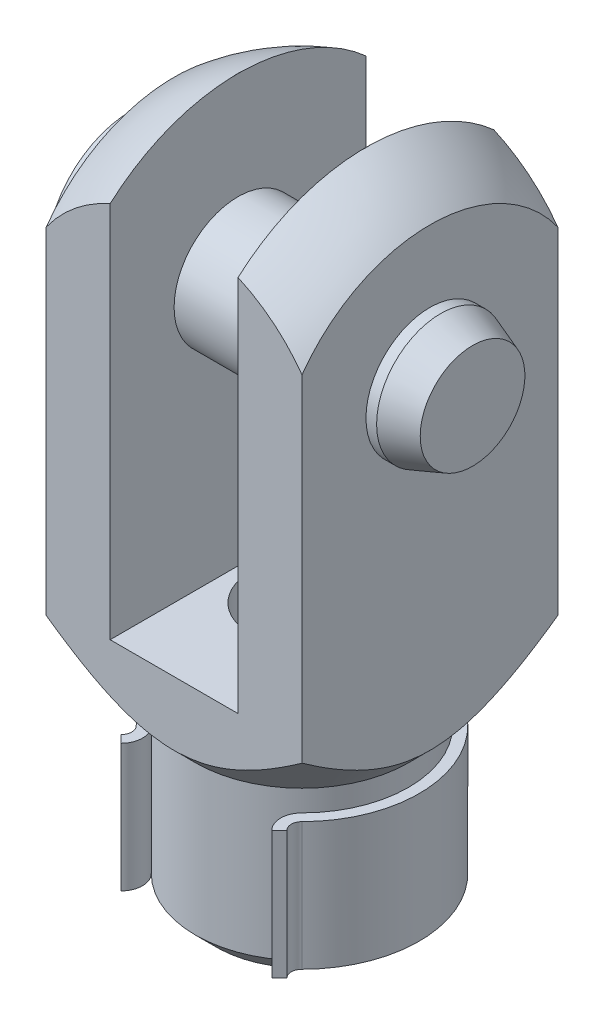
ISO-10303-21;
HEADER;
FILE_DESCRIPTION(('STEP AP214'),'2;1');
FILE_NAME('part.step','',(''),(''),'','','');
FILE_SCHEMA(('AUTOMOTIVE_DESIGN { 1 0 10303 214 1 1 1 1 }'));
ENDSEC;
DATA;
#1=APPLICATION_CONTEXT('core data for automotive mechanical design processes');
#2=APPLICATION_PROTOCOL_DEFINITION('international standard','automotive_design',2000,#1);
#3=PRODUCT_CONTEXT('',#1,'mechanical');
#4=PRODUCT('Part','Part','',(#3));
#5=PRODUCT_RELATED_PRODUCT_CATEGORY('part','',(#4));
#6=PRODUCT_DEFINITION_FORMATION('','',#4);
#7=PRODUCT_DEFINITION_CONTEXT('part definition',#1,'design');
#8=PRODUCT_DEFINITION('design','',#6,#7);
#9=PRODUCT_DEFINITION_SHAPE('','',#8);
#10=(LENGTH_UNIT() NAMED_UNIT(*) SI_UNIT(.MILLI.,.METRE.));
#11=(NAMED_UNIT(*) PLANE_ANGLE_UNIT() SI_UNIT($,.RADIAN.));
#12=(NAMED_UNIT(*) SI_UNIT($,.STERADIAN.) SOLID_ANGLE_UNIT());
#13=UNCERTAINTY_MEASURE_WITH_UNIT(LENGTH_MEASURE(1.E-05),#10,'distance_accuracy_value','');
#14=(GEOMETRIC_REPRESENTATION_CONTEXT(3) GLOBAL_UNCERTAINTY_ASSIGNED_CONTEXT((#13)) GLOBAL_UNIT_ASSIGNED_CONTEXT((#10,
#11,#12)) REPRESENTATION_CONTEXT('',''));
#15=CARTESIAN_POINT('',(0.,0.,0.));
#16=DIRECTION('',(0.,0.,1.));
#17=DIRECTION('',(1.,0.,0.));
#18=AXIS2_PLACEMENT_3D('',#15,#16,#17);
#19=CARTESIAN_POINT('',(-6.,0.,-9.5));
#20=DIRECTION('',(1.,0.,0.));
#21=DIRECTION('',(0.,0.,-1.));
#22=AXIS2_PLACEMENT_3D('',#19,#20,#21);
#23=PLANE('',#22);
#24=CARTESIAN_POINT('',(-6.,16.,0.));
#25=DIRECTION('',(-1.,0.,0.));
#26=DIRECTION('',(0.,0.,1.));
#27=AXIS2_PLACEMENT_3D('',#24,#25,#26);
#28=CIRCLE('',#27,1.);
#29=CARTESIAN_POINT('',(-6.,16.,1.));
#30=VERTEX_POINT('',#29);
#31=EDGE_CURVE('E880',#30,#30,#28,.T.);
#32=ORIENTED_EDGE('',*,*,#31,.T.);
#33=EDGE_LOOP('',(#32));
#34=FACE_BOUND('',#33,.T.);
#35=ADVANCED_FACE('F17',(#34),#23,.F.);
#36=CARTESIAN_POINT('',(8.,16.,0.));
#37=DIRECTION('',(-1.,0.,0.));
#38=DIRECTION('',(0.,0.,1.));
#39=AXIS2_PLACEMENT_3D('',#36,#37,#38);
#40=CYLINDRICAL_SURFACE('',#39,1.);
#41=ORIENTED_EDGE('',*,*,#31,.F.);
#42=EDGE_LOOP('',(#41));
#43=FACE_BOUND('',#42,.T.);
#44=CARTESIAN_POINT('',(-7.3,16.,0.));
#45=DIRECTION('',(-1.,0.,0.));
#46=DIRECTION('',(0.,0.,1.));
#47=AXIS2_PLACEMENT_3D('',#44,#45,#46);
#48=CIRCLE('',#47,1.);
#49=CARTESIAN_POINT('',(-7.3,16.,1.));
#50=VERTEX_POINT('',#49);
#51=EDGE_CURVE('E296',#50,#50,#48,.F.);
#52=ORIENTED_EDGE('',*,*,#51,.F.);
#53=EDGE_LOOP('',(#52));
#54=FACE_BOUND('',#53,.T.);
#55=ADVANCED_FACE('F317',(#43,#54),#40,.F.);
#56=CARTESIAN_POINT('',(-7.3,16.,0.));
#57=DIRECTION('',(-1.,0.,0.));
#58=DIRECTION('',(0.,0.,1.));
#59=AXIS2_PLACEMENT_3D('',#56,#57,#58);
#60=TOROIDAL_SURFACE('',#59,1.5,0.499999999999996);
#61=ORIENTED_EDGE('',*,*,#51,.T.);
#62=EDGE_LOOP('',(#61));
#63=FACE_BOUND('',#62,.T.);
#64=CARTESIAN_POINT('',(-7.8,16.,0.));
#65=DIRECTION('',(-1.,0.,0.));
#66=DIRECTION('',(0.,0.,1.));
#67=AXIS2_PLACEMENT_3D('',#64,#65,#66);
#68=CIRCLE('',#67,1.5);
#69=CARTESIAN_POINT('',(-7.8,16.,1.5));
#70=VERTEX_POINT('',#69);
#71=CARTESIAN_POINT('',(-7.8,16.,-1.5));
#72=VERTEX_POINT('',#71);
#73=EDGE_CURVE('E293',#70,#72,#68,.T.);
#74=ORIENTED_EDGE('',*,*,#73,.T.);
#75=CARTESIAN_POINT('',(-7.8,16.,0.));
#76=DIRECTION('',(-1.,0.,0.));
#77=DIRECTION('',(0.,0.,-1.));
#78=AXIS2_PLACEMENT_3D('',#75,#76,#77);
#79=CIRCLE('',#78,1.5);
#80=EDGE_CURVE('E289',#72,#70,#79,.T.);
#81=ORIENTED_EDGE('',*,*,#80,.T.);
#82=EDGE_LOOP('',(#74,#81));
#83=FACE_BOUND('',#82,.T.);
#84=ADVANCED_FACE('F300',(#63,#83),#60,.T.);
#85=CARTESIAN_POINT('',(-7.8,17.5,0.));
#86=DIRECTION('',(1.,0.,0.));
#87=DIRECTION('',(0.,0.,-1.));
#88=AXIS2_PLACEMENT_3D('',#85,#86,#87);
#89=PLANE('',#88);
#90=CARTESIAN_POINT('',(-7.8,16.,0.));
#91=DIRECTION('',(1.,0.,0.));
#92=DIRECTION('',(0.,0.,1.));
#93=AXIS2_PLACEMENT_3D('',#90,#91,#92);
#94=CIRCLE('',#93,2.42727272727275);
#95=CARTESIAN_POINT('',(-7.8,16.,2.42727272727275));
#96=VERTEX_POINT('',#95);
#97=CARTESIAN_POINT('',(-7.8,16.,-2.42727272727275));
#98=VERTEX_POINT('',#97);
#99=EDGE_CURVE('E301',#96,#98,#94,.T.);
#100=ORIENTED_EDGE('',*,*,#99,.F.);
#101=CARTESIAN_POINT('',(-7.8,16.,0.));
#102=DIRECTION('',(1.,0.,0.));
#103=DIRECTION('',(0.,0.,-1.));
#104=AXIS2_PLACEMENT_3D('',#101,#102,#103);
#105=CIRCLE('',#104,2.42727272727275);
#106=EDGE_CURVE('E855',#98,#96,#105,.T.);
#107=ORIENTED_EDGE('',*,*,#106,.F.);
#108=EDGE_LOOP('',(#100,#107));
#109=FACE_BOUND('',#108,.T.);
#110=ORIENTED_EDGE('',*,*,#80,.F.);
#111=ORIENTED_EDGE('',*,*,#73,.F.);
#112=EDGE_LOOP('',(#110,#111));
#113=FACE_BOUND('',#112,.T.);
#114=ADVANCED_FACE('F292',(#109,#113),#89,.F.);
#115=CARTESIAN_POINT('',(-7.49999999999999,16.,0.));
#116=DIRECTION('',(-1.,0.,0.));
#117=DIRECTION('',(0.,0.,1.));
#118=AXIS2_PLACEMENT_3D('',#115,#116,#117);
#119=TOROIDAL_SURFACE('',#118,2.42727272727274,0.300000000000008);
#120=ORIENTED_EDGE('',*,*,#99,.T.);
#121=ORIENTED_EDGE('',*,*,#106,.T.);
#122=EDGE_LOOP('',(#120,#121));
#123=FACE_BOUND('',#122,.T.);
#124=CARTESIAN_POINT('',(-7.5,16.,0.));
#125=DIRECTION('',(-1.,0.,0.));
#126=DIRECTION('',(0.,0.,1.));
#127=AXIS2_PLACEMENT_3D('',#124,#125,#126);
#128=CIRCLE('',#127,2.72727272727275);
#129=CARTESIAN_POINT('',(-7.5,16.,2.72727272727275));
#130=VERTEX_POINT('',#129);
#131=EDGE_CURVE('E852',#130,#130,#128,.F.);
#132=ORIENTED_EDGE('',*,*,#131,.F.);
#133=EDGE_LOOP('',(#132));
#134=FACE_BOUND('',#133,.T.);
#135=ADVANCED_FACE('F857',(#123,#134),#119,.T.);
#136=CARTESIAN_POINT('',(8.,16.,0.));
#137=DIRECTION('',(-1.,0.,0.));
#138=DIRECTION('',(0.,0.,1.));
#139=AXIS2_PLACEMENT_3D('',#136,#137,#138);
#140=CYLINDRICAL_SURFACE('',#139,2.72727272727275);
#141=ORIENTED_EDGE('',*,*,#131,.T.);
#142=EDGE_LOOP('',(#141));
#143=FACE_BOUND('',#142,.T.);
#144=CARTESIAN_POINT('',(-7.14285714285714,16.,0.));
#145=DIRECTION('',(-1.,0.,0.));
#146=DIRECTION('',(0.,0.,1.));
#147=AXIS2_PLACEMENT_3D('',#144,#145,#146);
#148=CIRCLE('',#147,2.72727272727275);
#149=CARTESIAN_POINT('',(-7.14285714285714,16.,2.72727272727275));
#150=VERTEX_POINT('',#149);
#151=EDGE_CURVE('E854',#150,#150,#148,.T.);
#152=ORIENTED_EDGE('',*,*,#151,.T.);
#153=EDGE_LOOP('',(#152));
#154=FACE_BOUND('',#153,.T.);
#155=ADVANCED_FACE('F861',(#143,#154),#140,.T.);
#156=CARTESIAN_POINT('',(-7.14285714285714,18.7272727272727,0.));
#157=DIRECTION('',(-1.,0.,0.));
#158=DIRECTION('',(0.,0.,1.));
#159=AXIS2_PLACEMENT_3D('',#156,#157,#158);
#160=PLANE('',#159);
#161=CARTESIAN_POINT('',(-7.14285714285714,16.,0.));
#162=DIRECTION('',(-1.,0.,0.));
#163=DIRECTION('',(0.,0.,1.));
#164=AXIS2_PLACEMENT_3D('',#161,#162,#163);
#165=CIRCLE('',#164,2.);
#166=CARTESIAN_POINT('',(-7.14285714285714,16.,2.));
#167=VERTEX_POINT('',#166);
#168=EDGE_CURVE('E885',#167,#167,#165,.F.);
#169=ORIENTED_EDGE('',*,*,#168,.F.);
#170=EDGE_LOOP('',(#169));
#171=FACE_BOUND('',#170,.T.);
#172=ORIENTED_EDGE('',*,*,#151,.F.);
#173=EDGE_LOOP('',(#172));
#174=FACE_BOUND('',#173,.T.);
#175=ADVANCED_FACE('F1068',(#171,#174),#160,.F.);
#176=CARTESIAN_POINT('',(8.,16.,0.));
#177=DIRECTION('',(-1.,0.,0.));
#178=DIRECTION('',(0.,0.,1.));
#179=AXIS2_PLACEMENT_3D('',#176,#177,#178);
#180=CYLINDRICAL_SURFACE('',#179,2.);
#181=ORIENTED_EDGE('',*,*,#168,.T.);
#182=EDGE_LOOP('',(#181));
#183=FACE_BOUND('',#182,.T.);
#184=CARTESIAN_POINT('',(-6.,16.,0.));
#185=DIRECTION('',(-1.,0.,0.));
#186=DIRECTION('',(0.,0.,1.));
#187=AXIS2_PLACEMENT_3D('',#184,#185,#186);
#188=CIRCLE('',#187,2.);
#189=CARTESIAN_POINT('',(-6.,16.,2.));
#190=VERTEX_POINT('',#189);
#191=EDGE_CURVE('E832',#190,#190,#188,.T.);
#192=ORIENTED_EDGE('',*,*,#191,.T.);
#193=EDGE_LOOP('',(#192));
#194=FACE_BOUND('',#193,.T.);
#195=ADVANCED_FACE('F1065',(#183,#194),#180,.T.);
#196=CARTESIAN_POINT('',(-5.89999999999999,-0.70710678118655,1.2));
#197=DIRECTION('',(0.,0.,-1.));
#198=DIRECTION('',(-1.,0.,0.));
#199=AXIS2_PLACEMENT_3D('',#196,#197,#198);
#200=CYLINDRICAL_SURFACE('',#199,0.499999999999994);
#201=CARTESIAN_POINT('',(-5.89999999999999,-0.70710678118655,-1.2));
#202=DIRECTION('',(0.,0.,-1.));
#203=DIRECTION('',(-1.,0.,0.));
#204=AXIS2_PLACEMENT_3D('',#201,#202,#203);
#205=CIRCLE('',#204,0.499999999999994);
#206=CARTESIAN_POINT('',(-5.4,-0.707106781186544,-1.2));
#207=VERTEX_POINT('',#206);
#208=CARTESIAN_POINT('',(-5.54644660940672,-0.35355339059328,-1.2));
#209=VERTEX_POINT('',#208);
#210=EDGE_CURVE('E891',#207,#209,#205,.F.);
#211=ORIENTED_EDGE('',*,*,#210,.F.);
#212=DIRECTION('',(0.,0.,1.));
#213=VECTOR('',#212,1.);
#214=CARTESIAN_POINT('',(-5.4,-0.707106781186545,1.2));
#215=LINE('',#214,#213);
#216=CARTESIAN_POINT('',(-5.4,-0.707106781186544,1.2));
#217=VERTEX_POINT('',#216);
#218=EDGE_CURVE('E803',#207,#217,#215,.T.);
#219=ORIENTED_EDGE('',*,*,#218,.T.);
#220=CARTESIAN_POINT('',(-5.89999999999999,-0.70710678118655,1.2));
#221=DIRECTION('',(0.,0.,-1.));
#222=DIRECTION('',(-1.,0.,0.));
#223=AXIS2_PLACEMENT_3D('',#220,#221,#222);
#224=CIRCLE('',#223,0.499999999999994);
#225=CARTESIAN_POINT('',(-5.54644660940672,-0.35355339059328,1.2));
#226=VERTEX_POINT('',#225);
#227=EDGE_CURVE('E888',#226,#217,#224,.T.);
#228=ORIENTED_EDGE('',*,*,#227,.F.);
#229=DIRECTION('',(0.,0.,1.));
#230=VECTOR('',#229,1.);
#231=CARTESIAN_POINT('',(-5.54644660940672,-0.353553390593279,1.2));
#232=LINE('',#231,#230);
#233=EDGE_CURVE('E793',#226,#209,#232,.F.);
#234=ORIENTED_EDGE('',*,*,#233,.T.);
#235=EDGE_LOOP('',(#211,#219,#228,#234));
#236=FACE_BOUND('',#235,.T.);
#237=ADVANCED_FACE('F1061',(#236),#200,.F.);
#238=CARTESIAN_POINT('',(-6.97830309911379,1.78540988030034,1.2));
#239=DIRECTION('',(0.,0.,-1.));
#240=DIRECTION('',(-1.,0.,0.));
#241=AXIS2_PLACEMENT_3D('',#238,#239,#240);
#242=CYLINDRICAL_SURFACE('',#241,0.500000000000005);
#243=CARTESIAN_POINT('',(-6.97830309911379,1.78540988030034,-1.2));
#244=DIRECTION('',(0.,0.,-1.));
#245=DIRECTION('',(-1.,0.,0.));
#246=AXIS2_PLACEMENT_3D('',#243,#244,#245);
#247=CIRCLE('',#246,0.500000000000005);
#248=CARTESIAN_POINT('',(-7.47491436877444,1.84352396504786,-1.2));
#249=VERTEX_POINT('',#248);
#250=CARTESIAN_POINT('',(-7.33185648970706,1.43185648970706,-1.2));
#251=VERTEX_POINT('',#250);
#252=EDGE_CURVE('E256',#249,#251,#247,.F.);
#253=ORIENTED_EDGE('',*,*,#252,.T.);
#254=DIRECTION('',(0.,0.,1.));
#255=VECTOR('',#254,1.);
#256=CARTESIAN_POINT('',(-7.33185648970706,1.43185648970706,1.2));
#257=LINE('',#256,#255);
#258=CARTESIAN_POINT('',(-7.33185648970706,1.43185648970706,1.2));
#259=VERTEX_POINT('',#258);
#260=EDGE_CURVE('E790',#251,#259,#257,.T.);
#261=ORIENTED_EDGE('',*,*,#260,.T.);
#262=CARTESIAN_POINT('',(-6.97830309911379,1.78540988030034,1.2));
#263=DIRECTION('',(0.,0.,-1.));
#264=DIRECTION('',(-1.,0.,0.));
#265=AXIS2_PLACEMENT_3D('',#262,#263,#264);
#266=CIRCLE('',#265,0.500000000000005);
#267=CARTESIAN_POINT('',(-7.47491436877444,1.84352396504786,1.2));
#268=VERTEX_POINT('',#267);
#269=EDGE_CURVE('E893',#259,#268,#266,.T.);
#270=ORIENTED_EDGE('',*,*,#269,.T.);
#271=DIRECTION('',(0.,0.,1.));
#272=VECTOR('',#271,1.);
#273=CARTESIAN_POINT('',(-7.47491436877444,1.84352396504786,1.2));
#274=LINE('',#273,#272);
#275=EDGE_CURVE('E799',#268,#249,#274,.F.);
#276=ORIENTED_EDGE('',*,*,#275,.T.);
#277=EDGE_LOOP('',(#253,#261,#270,#276));
#278=FACE_BOUND('',#277,.T.);
#279=ADVANCED_FACE('F1057',(#278),#242,.T.);
#280=CARTESIAN_POINT('',(-6.,0.,-9.5));
#281=DIRECTION('',(1.,0.,0.));
#282=DIRECTION('',(0.,0.,-1.));
#283=AXIS2_PLACEMENT_3D('',#280,#281,#282);
#284=PLANE('',#283);
#285=DIRECTION('',(0.,-0.707106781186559,0.707106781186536));
#286=VECTOR('',#285,1.);
#287=CARTESIAN_POINT('',(-6.,14.0071067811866,-3.5));
#288=LINE('',#287,#286);
#289=CARTESIAN_POINT('',(-6.,11.,-0.49289321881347));
#290=VERTEX_POINT('',#289);
#291=CARTESIAN_POINT('',(-6.,14.0071067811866,-3.5));
#292=VERTEX_POINT('',#291);
#293=EDGE_CURVE('E773',#290,#292,#288,.F.);
#294=ORIENTED_EDGE('',*,*,#293,.F.);
#295=DIRECTION('',(0.,0.,-1.));
#296=VECTOR('',#295,1.);
#297=CARTESIAN_POINT('',(-6.,11.,1.2));
#298=LINE('',#297,#296);
#299=CARTESIAN_POINT('',(-6.,11.,0.492893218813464));
#300=VERTEX_POINT('',#299);
#301=EDGE_CURVE('E820',#290,#300,#298,.F.);
#302=ORIENTED_EDGE('',*,*,#301,.T.);
#303=DIRECTION('',(0.,0.707106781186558,0.707106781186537));
#304=VECTOR('',#303,1.);
#305=CARTESIAN_POINT('',(-6.,11.,0.492893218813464));
#306=LINE('',#305,#304);
#307=CARTESIAN_POINT('',(-6.,14.0071067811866,3.5));
#308=VERTEX_POINT('',#307);
#309=EDGE_CURVE('E750',#308,#300,#306,.F.);
#310=ORIENTED_EDGE('',*,*,#309,.F.);
#311=DIRECTION('',(0.,1.,0.));
#312=VECTOR('',#311,1.);
#313=CARTESIAN_POINT('',(-6.,14.0071067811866,3.5));
#314=LINE('',#313,#312);
#315=CARTESIAN_POINT('',(-6.,16.,3.5));
#316=VERTEX_POINT('',#315);
#317=EDGE_CURVE('E751',#316,#308,#314,.F.);
#318=ORIENTED_EDGE('',*,*,#317,.F.);
#319=CARTESIAN_POINT('',(-6.,16.,0.));
#320=DIRECTION('',(1.,0.,0.));
#321=DIRECTION('',(0.,0.,-1.));
#322=AXIS2_PLACEMENT_3D('',#319,#320,#321);
#323=CIRCLE('',#322,3.5);
#324=CARTESIAN_POINT('',(-6.,16.,-3.5));
#325=VERTEX_POINT('',#324);
#326=EDGE_CURVE('E755',#316,#325,#323,.F.);
#327=ORIENTED_EDGE('',*,*,#326,.T.);
#328=DIRECTION('',(0.,1.,0.));
#329=VECTOR('',#328,1.);
#330=CARTESIAN_POINT('',(-6.,16.,-3.5));
#331=LINE('',#330,#329);
#332=EDGE_CURVE('E759',#292,#325,#331,.T.);
#333=ORIENTED_EDGE('',*,*,#332,.F.);
#334=EDGE_LOOP('',(#294,#302,#310,#318,#327,#333));
#335=FACE_BOUND('',#334,.T.);
#336=ORIENTED_EDGE('',*,*,#191,.F.);
#337=EDGE_LOOP('',(#336));
#338=FACE_BOUND('',#337,.T.);
#339=ADVANCED_FACE('F1053',(#335,#338),#284,.F.);
#340=CARTESIAN_POINT('',(-5.9,11.,1.2));
#341=DIRECTION('',(0.,-1.,0.));
#342=DIRECTION('',(0.,0.,-1.));
#343=AXIS2_PLACEMENT_3D('',#340,#341,#342);
#344=PLANE('',#343);
#345=DIRECTION('',(1.,0.,0.));
#346=VECTOR('',#345,1.);
#347=CARTESIAN_POINT('',(-8.,11.,-0.49289321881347));
#348=LINE('',#347,#346);
#349=CARTESIAN_POINT('',(-6.40341185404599,11.,-0.492893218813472));
#350=VERTEX_POINT('',#349);
#351=EDGE_CURVE('E770',#350,#290,#348,.T.);
#352=ORIENTED_EDGE('',*,*,#351,.F.);
#353=DIRECTION('',(0.,0.,1.));
#354=VECTOR('',#353,1.);
#355=CARTESIAN_POINT('',(-6.40341185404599,11.,1.2));
#356=LINE('',#355,#354);
#357=CARTESIAN_POINT('',(-6.40341185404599,11.,0.492893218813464));
#358=VERTEX_POINT('',#357);
#359=EDGE_CURVE('E798',#350,#358,#356,.T.);
#360=ORIENTED_EDGE('',*,*,#359,.T.);
#361=DIRECTION('',(1.,0.,0.));
#362=VECTOR('',#361,1.);
#363=CARTESIAN_POINT('',(-8.,11.,0.492893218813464));
#364=LINE('',#363,#362);
#365=EDGE_CURVE('E744',#300,#358,#364,.F.);
#366=ORIENTED_EDGE('',*,*,#365,.F.);
#367=ORIENTED_EDGE('',*,*,#301,.F.);
#368=EDGE_LOOP('',(#352,#360,#366,#367));
#369=FACE_BOUND('',#368,.T.);
#370=ADVANCED_FACE('F1049',(#369),#344,.F.);
#371=CARTESIAN_POINT('',(-5.4,-0.707106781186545,1.2));
#372=DIRECTION('',(1.,0.,0.));
#373=DIRECTION('',(0.,1.,0.));
#374=AXIS2_PLACEMENT_3D('',#371,#372,#373);
#375=PLANE('',#374);
#376=DIRECTION('',(0.,1.,0.));
#377=VECTOR('',#376,1.);
#378=CARTESIAN_POINT('',(-5.4,-0.707106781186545,-1.2));
#379=LINE('',#378,#377);
#380=CARTESIAN_POINT('',(-5.39999999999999,-1.,-1.2));
#381=VERTEX_POINT('',#380);
#382=EDGE_CURVE('E815',#381,#207,#379,.T.);
#383=ORIENTED_EDGE('',*,*,#382,.F.);
#384=DIRECTION('',(0.,0.,1.));
#385=VECTOR('',#384,1.);
#386=CARTESIAN_POINT('',(-5.39999999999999,-1.,1.2));
#387=LINE('',#386,#385);
#388=CARTESIAN_POINT('',(-5.39999999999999,-1.,-1.0440306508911));
#389=VERTEX_POINT('',#388);
#390=EDGE_CURVE('E812',#389,#381,#387,.F.);
#391=ORIENTED_EDGE('',*,*,#390,.F.);
#392=DIRECTION('',(0.,0.,-1.));
#393=VECTOR('',#392,1.);
#394=CARTESIAN_POINT('',(-5.39999999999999,-1.,4.24264068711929));
#395=LINE('',#394,#393);
#396=CARTESIAN_POINT('',(-5.39999999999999,-1.,1.0440306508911));
#397=VERTEX_POINT('',#396);
#398=EDGE_CURVE('E722',#389,#397,#395,.F.);
#399=ORIENTED_EDGE('',*,*,#398,.T.);
#400=DIRECTION('',(0.,0.,1.));
#401=VECTOR('',#400,1.);
#402=CARTESIAN_POINT('',(-5.39999999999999,-1.,1.2));
#403=LINE('',#402,#401);
#404=CARTESIAN_POINT('',(-5.39999999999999,-1.,1.2));
#405=VERTEX_POINT('',#404);
#406=EDGE_CURVE('E725',#397,#405,#403,.T.);
#407=ORIENTED_EDGE('',*,*,#406,.T.);
#408=DIRECTION('',(0.,1.,0.));
#409=VECTOR('',#408,1.);
#410=CARTESIAN_POINT('',(-5.4,-0.707106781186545,1.2));
#411=LINE('',#410,#409);
#412=EDGE_CURVE('E816',#217,#405,#411,.F.);
#413=ORIENTED_EDGE('',*,*,#412,.F.);
#414=ORIENTED_EDGE('',*,*,#218,.F.);
#415=EDGE_LOOP('',(#383,#391,#399,#407,#413,#414));
#416=FACE_BOUND('',#415,.T.);
#417=ADVANCED_FACE('F1046',(#416),#375,.F.);
#418=CARTESIAN_POINT('',(-6.40341185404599,11.,1.2));
#419=DIRECTION('',(0.99322253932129,-0.116228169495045,0.));
#420=DIRECTION('',(0.116228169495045,0.99322253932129,0.));
#421=AXIS2_PLACEMENT_3D('',#418,#419,#420);
#422=PLANE('',#421);
#423=ORIENTED_EDGE('',*,*,#359,.F.);
#424=DIRECTION('',(0.,0.,1.));
#425=VECTOR('',#424,1.);
#426=CARTESIAN_POINT('',(-6.40341185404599,11.,1.2));
#427=LINE('',#426,#425);
#428=CARTESIAN_POINT('',(-6.40341185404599,11.,-1.2));
#429=VERTEX_POINT('',#428);
#430=EDGE_CURVE('E264',#429,#350,#427,.T.);
#431=ORIENTED_EDGE('',*,*,#430,.F.);
#432=DIRECTION('',(-0.116228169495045,-0.99322253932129,0.));
#433=VECTOR('',#432,1.);
#434=CARTESIAN_POINT('',(-6.40341185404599,11.,-1.2));
#435=LINE('',#434,#433);
#436=EDGE_CURVE('E642',#429,#249,#435,.T.);
#437=ORIENTED_EDGE('',*,*,#436,.T.);
#438=ORIENTED_EDGE('',*,*,#275,.F.);
#439=DIRECTION('',(-0.116228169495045,-0.99322253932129,0.));
#440=VECTOR('',#439,1.);
#441=CARTESIAN_POINT('',(-6.40341185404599,11.,1.2));
#442=LINE('',#441,#440);
#443=CARTESIAN_POINT('',(-6.40341185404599,11.,1.2));
#444=VERTEX_POINT('',#443);
#445=EDGE_CURVE('E674',#444,#268,#442,.T.);
#446=ORIENTED_EDGE('',*,*,#445,.F.);
#447=DIRECTION('',(0.,0.,1.));
#448=VECTOR('',#447,1.);
#449=CARTESIAN_POINT('',(-6.40341185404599,11.,1.2));
#450=LINE('',#449,#448);
#451=EDGE_CURVE('E796',#358,#444,#450,.T.);
#452=ORIENTED_EDGE('',*,*,#451,.F.);
#453=EDGE_LOOP('',(#423,#431,#437,#438,#446,#452));
#454=FACE_BOUND('',#453,.T.);
#455=ADVANCED_FACE('F1042',(#454),#422,.F.);
#456=CARTESIAN_POINT('',(-7.33185648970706,1.43185648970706,1.2));
#457=DIRECTION('',(0.707106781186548,0.707106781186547,0.));
#458=DIRECTION('',(-0.707106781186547,0.707106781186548,0.));
#459=AXIS2_PLACEMENT_3D('',#456,#457,#458);
#460=PLANE('',#459);
#461=DIRECTION('',(0.707106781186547,-0.707106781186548,0.));
#462=VECTOR('',#461,1.);
#463=CARTESIAN_POINT('',(-7.33185648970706,1.43185648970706,-1.2));
#464=LINE('',#463,#462);
#465=EDGE_CURVE('E638',#251,#209,#464,.T.);
#466=ORIENTED_EDGE('',*,*,#465,.T.);
#467=ORIENTED_EDGE('',*,*,#233,.F.);
#468=DIRECTION('',(0.707106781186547,-0.707106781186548,0.));
#469=VECTOR('',#468,1.);
#470=CARTESIAN_POINT('',(-7.33185648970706,1.43185648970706,1.2));
#471=LINE('',#470,#469);
#472=EDGE_CURVE('E671',#259,#226,#471,.T.);
#473=ORIENTED_EDGE('',*,*,#472,.F.);
#474=ORIENTED_EDGE('',*,*,#260,.F.);
#475=EDGE_LOOP('',(#466,#467,#473,#474));
#476=FACE_BOUND('',#475,.T.);
#477=ADVANCED_FACE('F1038',(#476),#460,.F.);
#478=CARTESIAN_POINT('',(-8.,14.0071067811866,-3.5));
#479=DIRECTION('',(0.,0.707106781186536,0.707106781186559));
#480=DIRECTION('',(0.,-0.707106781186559,0.707106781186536));
#481=AXIS2_PLACEMENT_3D('',#478,#479,#480);
#482=PLANE('',#481);
#483=DIRECTION('',(1.,0.,0.));
#484=VECTOR('',#483,1.);
#485=CARTESIAN_POINT('',(-8.,11.,-0.492893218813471));
#486=LINE('',#485,#484);
#487=CARTESIAN_POINT('',(-8.,11.,-0.492893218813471));
#488=VERTEX_POINT('',#487);
#489=EDGE_CURVE('E605',#350,#488,#486,.F.);
#490=ORIENTED_EDGE('',*,*,#489,.F.);
#491=ORIENTED_EDGE('',*,*,#351,.T.);
#492=ORIENTED_EDGE('',*,*,#293,.T.);
#493=DIRECTION('',(1.,0.,0.));
#494=VECTOR('',#493,1.);
#495=CARTESIAN_POINT('',(-8.,14.0071067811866,-3.5));
#496=LINE('',#495,#494);
#497=CARTESIAN_POINT('',(-8.,14.0071067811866,-3.5));
#498=VERTEX_POINT('',#497);
#499=EDGE_CURVE('E756',#498,#292,#496,.T.);
#500=ORIENTED_EDGE('',*,*,#499,.F.);
#501=DIRECTION('',(0.,0.707106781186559,-0.707106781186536));
#502=VECTOR('',#501,1.);
#503=CARTESIAN_POINT('',(-8.,11.,-0.492893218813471));
#504=LINE('',#503,#502);
#505=EDGE_CURVE('E599',#488,#498,#504,.T.);
#506=ORIENTED_EDGE('',*,*,#505,.F.);
#507=EDGE_LOOP('',(#490,#491,#492,#500,#506));
#508=FACE_BOUND('',#507,.T.);
#509=ADVANCED_FACE('F1034',(#508),#482,.T.);
#510=CARTESIAN_POINT('',(-8.,16.,-3.5));
#511=DIRECTION('',(0.,0.,1.));
#512=DIRECTION('',(1.,0.,0.));
#513=AXIS2_PLACEMENT_3D('',#510,#511,#512);
#514=PLANE('',#513);
#515=DIRECTION('',(0.,1.,0.));
#516=VECTOR('',#515,1.);
#517=CARTESIAN_POINT('',(-8.,16.,-3.5));
#518=LINE('',#517,#516);
#519=CARTESIAN_POINT('',(-8.,16.,-3.5));
#520=VERTEX_POINT('',#519);
#521=EDGE_CURVE('E597',#498,#520,#518,.T.);
#522=ORIENTED_EDGE('',*,*,#521,.F.);
#523=ORIENTED_EDGE('',*,*,#499,.T.);
#524=ORIENTED_EDGE('',*,*,#332,.T.);
#525=DIRECTION('',(1.,0.,0.));
#526=VECTOR('',#525,1.);
#527=CARTESIAN_POINT('',(-8.,16.,-3.5));
#528=LINE('',#527,#526);
#529=EDGE_CURVE('E752',#325,#520,#528,.F.);
#530=ORIENTED_EDGE('',*,*,#529,.T.);
#531=EDGE_LOOP('',(#522,#523,#524,#530));
#532=FACE_BOUND('',#531,.T.);
#533=ADVANCED_FACE('F1030',(#532),#514,.T.);
#534=CARTESIAN_POINT('',(-8.,16.,0.));
#535=DIRECTION('',(1.,0.,0.));
#536=DIRECTION('',(0.,0.,-1.));
#537=AXIS2_PLACEMENT_3D('',#534,#535,#536);
#538=CYLINDRICAL_SURFACE('',#537,3.5);
#539=DIRECTION('',(-1.,0.,0.));
#540=VECTOR('',#539,1.);
#541=CARTESIAN_POINT('',(-8.,16.,3.5));
#542=LINE('',#541,#540);
#543=CARTESIAN_POINT('',(-8.,16.,3.5));
#544=VERTEX_POINT('',#543);
#545=EDGE_CURVE('E747',#544,#316,#542,.F.);
#546=ORIENTED_EDGE('',*,*,#545,.F.);
#547=CARTESIAN_POINT('',(-8.,16.,0.));
#548=DIRECTION('',(1.,0.,0.));
#549=DIRECTION('',(0.,0.,-1.));
#550=AXIS2_PLACEMENT_3D('',#547,#548,#549);
#551=CIRCLE('',#550,3.5);
#552=EDGE_CURVE('E594',#520,#544,#551,.T.);
#553=ORIENTED_EDGE('',*,*,#552,.F.);
#554=ORIENTED_EDGE('',*,*,#529,.F.);
#555=ORIENTED_EDGE('',*,*,#326,.F.);
#556=EDGE_LOOP('',(#546,#553,#554,#555));
#557=FACE_BOUND('',#556,.T.);
#558=ADVANCED_FACE('F1026',(#557),#538,.F.);
#559=CARTESIAN_POINT('',(-8.,14.0071067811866,3.5));
#560=DIRECTION('',(0.,0.,-1.));
#561=DIRECTION('',(-1.,0.,0.));
#562=AXIS2_PLACEMENT_3D('',#559,#560,#561);
#563=PLANE('',#562);
#564=DIRECTION('',(0.,1.,0.));
#565=VECTOR('',#564,1.);
#566=CARTESIAN_POINT('',(-8.,16.,3.5));
#567=LINE('',#566,#565);
#568=CARTESIAN_POINT('',(-8.,14.0071067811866,3.5));
#569=VERTEX_POINT('',#568);
#570=EDGE_CURVE('E590',#544,#569,#567,.F.);
#571=ORIENTED_EDGE('',*,*,#570,.F.);
#572=ORIENTED_EDGE('',*,*,#545,.T.);
#573=ORIENTED_EDGE('',*,*,#317,.T.);
#574=DIRECTION('',(1.,0.,0.));
#575=VECTOR('',#574,1.);
#576=CARTESIAN_POINT('',(-8.,14.0071067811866,3.5));
#577=LINE('',#576,#575);
#578=EDGE_CURVE('E740',#569,#308,#577,.T.);
#579=ORIENTED_EDGE('',*,*,#578,.F.);
#580=EDGE_LOOP('',(#571,#572,#573,#579));
#581=FACE_BOUND('',#580,.T.);
#582=ADVANCED_FACE('F1022',(#581),#563,.T.);
#583=CARTESIAN_POINT('',(-8.,11.,0.492893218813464));
#584=DIRECTION('',(0.,0.707106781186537,-0.707106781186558));
#585=DIRECTION('',(0.,0.707106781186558,0.707106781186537));
#586=AXIS2_PLACEMENT_3D('',#583,#584,#585);
#587=PLANE('',#586);
#588=DIRECTION('',(0.,-0.707106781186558,-0.707106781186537));
#589=VECTOR('',#588,1.);
#590=CARTESIAN_POINT('',(-8.,14.0071067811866,3.5));
#591=LINE('',#590,#589);
#592=CARTESIAN_POINT('',(-8.,11.,0.492893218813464));
#593=VERTEX_POINT('',#592);
#594=EDGE_CURVE('E593',#569,#593,#591,.T.);
#595=ORIENTED_EDGE('',*,*,#594,.F.);
#596=ORIENTED_EDGE('',*,*,#578,.T.);
#597=ORIENTED_EDGE('',*,*,#309,.T.);
#598=ORIENTED_EDGE('',*,*,#365,.T.);
#599=DIRECTION('',(1.,0.,0.));
#600=VECTOR('',#599,1.);
#601=CARTESIAN_POINT('',(-8.,11.,0.492893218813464));
#602=LINE('',#601,#600);
#603=EDGE_CURVE('E731',#593,#358,#602,.T.);
#604=ORIENTED_EDGE('',*,*,#603,.F.);
#605=EDGE_LOOP('',(#595,#596,#597,#598,#604));
#606=FACE_BOUND('',#605,.T.);
#607=ADVANCED_FACE('F1018',(#606),#587,.T.);
#608=CARTESIAN_POINT('',(-4.24264068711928,-7.,4.24264068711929));
#609=DIRECTION('',(0.,1.,0.));
#610=DIRECTION('',(0.,0.,1.));
#611=AXIS2_PLACEMENT_3D('',#608,#609,#610);
#612=CYLINDRICAL_SURFACE('',#611,0.5);
#613=DIRECTION('',(0.,1.,0.));
#614=VECTOR('',#613,1.);
#615=CARTESIAN_POINT('',(-3.88908729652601,-7.,3.88908729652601));
#616=LINE('',#615,#614);
#617=CARTESIAN_POINT('',(-3.88908729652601,-7.,3.88908729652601));
#618=VERTEX_POINT('',#617);
#619=CARTESIAN_POINT('',(-3.88908729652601,-1.,3.88908729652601));
#620=VERTEX_POINT('',#619);
#621=EDGE_CURVE('E575',#618,#620,#616,.T.);
#622=ORIENTED_EDGE('',*,*,#621,.F.);
#623=CARTESIAN_POINT('',(-4.24264068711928,-7.,4.24264068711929));
#624=DIRECTION('',(0.,1.,0.));
#625=DIRECTION('',(0.,0.,1.));
#626=AXIS2_PLACEMENT_3D('',#623,#624,#625);
#627=CIRCLE('',#626,0.5);
#628=CARTESIAN_POINT('',(-3.88908729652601,-7.,4.59619407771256));
#629=VERTEX_POINT('',#628);
#630=EDGE_CURVE('E743',#629,#618,#627,.T.);
#631=ORIENTED_EDGE('',*,*,#630,.F.);
#632=DIRECTION('',(0.,1.,0.));
#633=VECTOR('',#632,1.);
#634=CARTESIAN_POINT('',(-3.88908729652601,-7.,4.59619407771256));
#635=LINE('',#634,#633);
#636=CARTESIAN_POINT('',(-3.88908729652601,-1.,4.59619407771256));
#637=VERTEX_POINT('',#636);
#638=EDGE_CURVE('E704',#637,#629,#635,.F.);
#639=ORIENTED_EDGE('',*,*,#638,.F.);
#640=CARTESIAN_POINT('',(-4.24264068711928,-1.,4.24264068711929));
#641=DIRECTION('',(0.,1.,0.));
#642=DIRECTION('',(0.,0.,1.));
#643=AXIS2_PLACEMENT_3D('',#640,#641,#642);
#644=CIRCLE('',#643,0.5);
#645=EDGE_CURVE('E728',#620,#637,#644,.F.);
#646=ORIENTED_EDGE('',*,*,#645,.F.);
#647=EDGE_LOOP('',(#622,#631,#639,#646));
#648=FACE_BOUND('',#647,.T.);
#649=ADVANCED_FACE('F1014',(#648),#612,.F.);
#650=CARTESIAN_POINT('',(-5.39999999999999,-1.,1.2));
#651=DIRECTION('',(0.,1.,0.));
#652=DIRECTION('',(0.,0.,1.));
#653=AXIS2_PLACEMENT_3D('',#650,#651,#652);
#654=PLANE('',#653);
#655=DIRECTION('',(1.,0.,0.));
#656=VECTOR('',#655,1.);
#657=CARTESIAN_POINT('',(-6.97830309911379,-1.,1.2));
#658=LINE('',#657,#656);
#659=CARTESIAN_POINT('',(-5.36749476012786,-1.,1.2));
#660=VERTEX_POINT('',#659);
#661=EDGE_CURVE('E670',#405,#660,#658,.T.);
#662=ORIENTED_EDGE('',*,*,#661,.F.);
#663=ORIENTED_EDGE('',*,*,#406,.F.);
#664=CARTESIAN_POINT('',(0.,-1.,0.));
#665=DIRECTION('',(0.,1.,0.));
#666=DIRECTION('',(0.,0.,1.));
#667=AXIS2_PLACEMENT_3D('',#664,#665,#666);
#668=CIRCLE('',#667,5.5);
#669=EDGE_CURVE('E697',#660,#397,#668,.F.);
#670=ORIENTED_EDGE('',*,*,#669,.F.);
#671=EDGE_LOOP('',(#662,#663,#670));
#672=FACE_BOUND('',#671,.T.);
#673=ADVANCED_FACE('F1010',(#672),#654,.F.);
#674=CARTESIAN_POINT('',(4.24264068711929,-1.,4.24264068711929));
#675=DIRECTION('',(0.,-1.,0.));
#676=DIRECTION('',(0.,0.,-1.));
#677=AXIS2_PLACEMENT_3D('',#674,#675,#676);
#678=PLANE('',#677);
#679=CARTESIAN_POINT('',(0.,-1.,0.));
#680=DIRECTION('',(0.,1.,0.));
#681=DIRECTION('',(0.,0.,1.));
#682=AXIS2_PLACEMENT_3D('',#679,#680,#681);
#683=CIRCLE('',#682,5.5);
#684=EDGE_CURVE('E910',#397,#389,#683,.F.);
#685=ORIENTED_EDGE('',*,*,#684,.F.);
#686=ORIENTED_EDGE('',*,*,#398,.F.);
#687=EDGE_LOOP('',(#685,#686));
#688=FACE_BOUND('',#687,.T.);
#689=ADVANCED_FACE('F1006',(#688),#678,.F.);
#690=CARTESIAN_POINT('',(-5.39999999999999,-1.,1.2));
#691=DIRECTION('',(0.,1.,0.));
#692=DIRECTION('',(0.,0.,1.));
#693=AXIS2_PLACEMENT_3D('',#690,#691,#692);
#694=PLANE('',#693);
#695=ORIENTED_EDGE('',*,*,#390,.T.);
#696=DIRECTION('',(1.,0.,0.));
#697=VECTOR('',#696,1.);
#698=CARTESIAN_POINT('',(-6.97830309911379,-1.,-1.2));
#699=LINE('',#698,#697);
#700=CARTESIAN_POINT('',(-5.36749476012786,-1.,-1.2));
#701=VERTEX_POINT('',#700);
#702=EDGE_CURVE('E641',#381,#701,#699,.T.);
#703=ORIENTED_EDGE('',*,*,#702,.T.);
#704=CARTESIAN_POINT('',(0.,-1.,0.));
#705=DIRECTION('',(0.,1.,0.));
#706=DIRECTION('',(0.,0.,1.));
#707=AXIS2_PLACEMENT_3D('',#704,#705,#706);
#708=CIRCLE('',#707,5.5);
#709=EDGE_CURVE('E565',#389,#701,#708,.F.);
#710=ORIENTED_EDGE('',*,*,#709,.F.);
#711=EDGE_LOOP('',(#695,#703,#710));
#712=FACE_BOUND('',#711,.T.);
#713=ADVANCED_FACE('F1002',(#712),#694,.F.);
#714=CARTESIAN_POINT('',(-5.04644660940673,-0.353553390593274,1.2));
#715=DIRECTION('',(-0.707106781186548,-0.707106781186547,0.));
#716=DIRECTION('',(0.707106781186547,-0.707106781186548,0.));
#717=AXIS2_PLACEMENT_3D('',#714,#715,#716);
#718=PLANE('',#717);
#719=DIRECTION('',(-0.707106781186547,0.707106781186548,0.));
#720=VECTOR('',#719,1.);
#721=CARTESIAN_POINT('',(-5.04644660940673,-0.353553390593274,-1.2));
#722=LINE('',#721,#720);
#723=CARTESIAN_POINT('',(-5.04644660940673,-0.353553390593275,-1.2));
#724=VERTEX_POINT('',#723);
#725=CARTESIAN_POINT('',(-6.8288020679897,1.4288020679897,-1.2));
#726=VERTEX_POINT('',#725);
#727=EDGE_CURVE('E633',#724,#726,#722,.T.);
#728=ORIENTED_EDGE('',*,*,#727,.T.);
#729=DIRECTION('',(0.,0.,1.));
#730=VECTOR('',#729,1.);
#731=CARTESIAN_POINT('',(-6.8288020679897,1.4288020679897,1.2));
#732=LINE('',#731,#730);
#733=CARTESIAN_POINT('',(-6.8288020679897,1.4288020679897,1.2));
#734=VERTEX_POINT('',#733);
#735=EDGE_CURVE('E715',#734,#726,#732,.F.);
#736=ORIENTED_EDGE('',*,*,#735,.F.);
#737=DIRECTION('',(-0.707106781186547,0.707106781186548,0.));
#738=VECTOR('',#737,1.);
#739=CARTESIAN_POINT('',(-5.04644660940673,-0.353553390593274,1.2));
#740=LINE('',#739,#738);
#741=CARTESIAN_POINT('',(-5.04644660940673,-0.353553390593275,1.2));
#742=VERTEX_POINT('',#741);
#743=EDGE_CURVE('E667',#742,#734,#740,.T.);
#744=ORIENTED_EDGE('',*,*,#743,.F.);
#745=DIRECTION('',(0.,0.,-1.));
#746=VECTOR('',#745,1.);
#747=CARTESIAN_POINT('',(-5.04644660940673,-0.353553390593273,1.2));
#748=LINE('',#747,#746);
#749=EDGE_CURVE('E716',#724,#742,#748,.F.);
#750=ORIENTED_EDGE('',*,*,#749,.F.);
#751=EDGE_LOOP('',(#728,#736,#744,#750));
#752=FACE_BOUND('',#751,.T.);
#753=ADVANCED_FACE('F998',(#752),#718,.F.);
#754=CARTESIAN_POINT('',(-3.88908729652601,-7.,4.59619407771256));
#755=DIRECTION('',(-0.707106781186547,0.,0.707106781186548));
#756=DIRECTION('',(0.707106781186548,0.,0.707106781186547));
#757=AXIS2_PLACEMENT_3D('',#754,#755,#756);
#758=PLANE('',#757);
#759=DIRECTION('',(0.707106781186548,0.,0.707106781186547));
#760=VECTOR('',#759,1.);
#761=CARTESIAN_POINT('',(-3.88908729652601,-7.,4.59619407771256));
#762=LINE('',#761,#760);
#763=CARTESIAN_POINT('',(-3.53553390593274,-7.,4.94974746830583));
#764=VERTEX_POINT('',#763);
#765=EDGE_CURVE('E702',#629,#764,#762,.T.);
#766=ORIENTED_EDGE('',*,*,#765,.T.);
#767=DIRECTION('',(0.,1.,0.));
#768=VECTOR('',#767,1.);
#769=CARTESIAN_POINT('',(-3.53553390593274,-7.,4.94974746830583));
#770=LINE('',#769,#768);
#771=CARTESIAN_POINT('',(-3.53553390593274,-1.,4.94974746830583));
#772=VERTEX_POINT('',#771);
#773=EDGE_CURVE('E698',#772,#764,#770,.F.);
#774=ORIENTED_EDGE('',*,*,#773,.F.);
#775=DIRECTION('',(-0.70710678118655,0.,-0.707106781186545));
#776=VECTOR('',#775,1.);
#777=CARTESIAN_POINT('',(-3.53553390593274,-1.,4.94974746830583));
#778=LINE('',#777,#776);
#779=EDGE_CURVE('E546',#772,#637,#778,.T.);
#780=ORIENTED_EDGE('',*,*,#779,.T.);
#781=ORIENTED_EDGE('',*,*,#638,.T.);
#782=EDGE_LOOP('',(#766,#774,#780,#781));
#783=FACE_BOUND('',#782,.T.);
#784=ADVANCED_FACE('F994',(#783),#758,.T.);
#785=CARTESIAN_POINT('',(4.24264068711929,-7.,4.24264068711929));
#786=DIRECTION('',(0.,1.,0.));
#787=DIRECTION('',(0.,0.,1.));
#788=AXIS2_PLACEMENT_3D('',#785,#786,#787);
#789=CYLINDRICAL_SURFACE('',#788,0.500000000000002);
#790=DIRECTION('',(0.,1.,0.));
#791=VECTOR('',#790,1.);
#792=CARTESIAN_POINT('',(3.88908729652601,-7.,4.59619407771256));
#793=LINE('',#792,#791);
#794=CARTESIAN_POINT('',(3.88908729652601,-7.,4.59619407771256));
#795=VERTEX_POINT('',#794);
#796=CARTESIAN_POINT('',(3.88908729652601,-1.,4.59619407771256));
#797=VERTEX_POINT('',#796);
#798=EDGE_CURVE('E568',#795,#797,#793,.T.);
#799=ORIENTED_EDGE('',*,*,#798,.F.);
#800=CARTESIAN_POINT('',(4.24264068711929,-7.,4.24264068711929));
#801=DIRECTION('',(0.,1.,0.));
#802=DIRECTION('',(0.,0.,1.));
#803=AXIS2_PLACEMENT_3D('',#800,#801,#802);
#804=CIRCLE('',#803,0.500000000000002);
#805=CARTESIAN_POINT('',(3.88908728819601,-7.,3.88908730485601));
#806=VERTEX_POINT('',#805);
#807=EDGE_CURVE('E924',#806,#795,#804,.T.);
#808=ORIENTED_EDGE('',*,*,#807,.F.);
#809=DIRECTION('',(0.,1.,0.));
#810=VECTOR('',#809,1.);
#811=CARTESIAN_POINT('',(3.88908727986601,-7.,3.88908731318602));
#812=LINE('',#811,#810);
#813=CARTESIAN_POINT('',(3.88908728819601,-1.,3.88908730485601));
#814=VERTEX_POINT('',#813);
#815=EDGE_CURVE('E573',#814,#806,#812,.F.);
#816=ORIENTED_EDGE('',*,*,#815,.F.);
#817=CARTESIAN_POINT('',(4.24264068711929,-1.,4.24264068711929));
#818=DIRECTION('',(0.,1.,0.));
#819=DIRECTION('',(0.,0.,1.));
#820=AXIS2_PLACEMENT_3D('',#817,#818,#819);
#821=CIRCLE('',#820,0.500000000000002);
#822=EDGE_CURVE('E687',#797,#814,#821,.F.);
#823=ORIENTED_EDGE('',*,*,#822,.F.);
#824=EDGE_LOOP('',(#799,#808,#816,#823));
#825=FACE_BOUND('',#824,.T.);
#826=ADVANCED_FACE('F990',(#825),#789,.F.);
#827=CARTESIAN_POINT('',(0.,-7.99999999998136,0.));
#828=DIRECTION('',(0.,-1.,0.));
#829=DIRECTION('',(0.,0.,-1.));
#830=AXIS2_PLACEMENT_3D('',#827,#828,#829);
#831=CONICAL_SURFACE('',#830,3.00000000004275,0.785398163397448);
#832=CARTESIAN_POINT('',(0.,-7.4585,0.));
#833=DIRECTION('',(0.,1.,0.));
#834=DIRECTION('',(0.,0.,1.));
#835=AXIS2_PLACEMENT_3D('',#832,#833,#834);
#836=CIRCLE('',#835,2.4585);
#837=CARTESIAN_POINT('',(0.,-7.4585,2.4585));
#838=VERTEX_POINT('',#837);
#839=EDGE_CURVE('E571',#838,#838,#836,.T.);
#840=ORIENTED_EDGE('',*,*,#839,.T.);
#841=EDGE_LOOP('',(#840));
#842=FACE_BOUND('',#841,.T.);
#843=CARTESIAN_POINT('',(0.,-7.99999999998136,0.));
#844=DIRECTION('',(0.,-1.,0.));
#845=DIRECTION('',(0.,0.,-1.));
#846=AXIS2_PLACEMENT_3D('',#843,#844,#845);
#847=CIRCLE('',#846,3.00000000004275);
#848=CARTESIAN_POINT('',(0.,-7.99999999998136,-3.00000000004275));
#849=VERTEX_POINT('',#848);
#850=EDGE_CURVE('E701',#849,#849,#847,.T.);
#851=ORIENTED_EDGE('',*,*,#850,.T.);
#852=EDGE_LOOP('',(#851));
#853=FACE_BOUND('',#852,.T.);
#854=ADVANCED_FACE('F986',(#842,#853),#831,.F.);
#855=CARTESIAN_POINT('',(-6.47524867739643,1.78235545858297,1.2));
#856=DIRECTION('',(0.,0.,-1.));
#857=DIRECTION('',(-1.,0.,0.));
#858=AXIS2_PLACEMENT_3D('',#855,#856,#857);
#859=CYLINDRICAL_SURFACE('',#858,0.499999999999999);
#860=CARTESIAN_POINT('',(-6.47524867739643,1.78235545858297,1.2));
#861=DIRECTION('',(0.,0.,-1.));
#862=DIRECTION('',(-1.,0.,0.));
#863=AXIS2_PLACEMENT_3D('',#860,#861,#862);
#864=CIRCLE('',#863,0.499999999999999);
#865=CARTESIAN_POINT('',(-6.97185994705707,1.84046954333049,1.2));
#866=VERTEX_POINT('',#865);
#867=EDGE_CURVE('E644',#734,#866,#864,.T.);
#868=ORIENTED_EDGE('',*,*,#867,.F.);
#869=ORIENTED_EDGE('',*,*,#735,.T.);
#870=CARTESIAN_POINT('',(-6.47524867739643,1.78235545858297,-1.2));
#871=DIRECTION('',(0.,0.,-1.));
#872=DIRECTION('',(-1.,0.,0.));
#873=AXIS2_PLACEMENT_3D('',#870,#871,#872);
#874=CIRCLE('',#873,0.499999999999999);
#875=CARTESIAN_POINT('',(-6.97185994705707,1.84046954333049,-1.2));
#876=VERTEX_POINT('',#875);
#877=EDGE_CURVE('E636',#726,#876,#874,.T.);
#878=ORIENTED_EDGE('',*,*,#877,.T.);
#879=DIRECTION('',(0.,0.,1.));
#880=VECTOR('',#879,1.);
#881=CARTESIAN_POINT('',(-6.97185994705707,1.8404695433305,1.2));
#882=LINE('',#881,#880);
#883=EDGE_CURVE('E647',#876,#866,#882,.T.);
#884=ORIENTED_EDGE('',*,*,#883,.T.);
#885=EDGE_LOOP('',(#868,#869,#878,#884));
#886=FACE_BOUND('',#885,.T.);
#887=ADVANCED_FACE('F982',(#886),#859,.F.);
#888=CARTESIAN_POINT('',(-6.97830309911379,1.78540988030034,1.2));
#889=DIRECTION('',(0.,0.,1.));
#890=DIRECTION('',(1.,0.,0.));
#891=AXIS2_PLACEMENT_3D('',#888,#889,#890);
#892=PLANE('',#891);
#893=ORIENTED_EDGE('',*,*,#867,.T.);
#894=DIRECTION('',(-0.116228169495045,-0.99322253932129,0.));
#895=VECTOR('',#894,1.);
#896=CARTESIAN_POINT('',(-6.97185994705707,1.8404695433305,1.2));
#897=LINE('',#896,#895);
#898=CARTESIAN_POINT('',(-6.,10.1454545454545,1.2));
#899=VERTEX_POINT('',#898);
#900=EDGE_CURVE('E650',#866,#899,#897,.F.);
#901=ORIENTED_EDGE('',*,*,#900,.T.);
#902=DIRECTION('',(0.,1.,0.));
#903=VECTOR('',#902,1.);
#904=CARTESIAN_POINT('',(-6.,1.78540988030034,1.2));
#905=LINE('',#904,#903);
#906=CARTESIAN_POINT('',(-6.,11.,1.2));
#907=VERTEX_POINT('',#906);
#908=EDGE_CURVE('E684',#899,#907,#905,.T.);
#909=ORIENTED_EDGE('',*,*,#908,.T.);
#910=DIRECTION('',(1.,0.,0.));
#911=VECTOR('',#910,1.);
#912=CARTESIAN_POINT('',(-6.97830309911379,11.,1.2));
#913=LINE('',#912,#911);
#914=EDGE_CURVE('E677',#907,#444,#913,.F.);
#915=ORIENTED_EDGE('',*,*,#914,.T.);
#916=ORIENTED_EDGE('',*,*,#445,.T.);
#917=ORIENTED_EDGE('',*,*,#269,.F.);
#918=ORIENTED_EDGE('',*,*,#472,.T.);
#919=ORIENTED_EDGE('',*,*,#227,.T.);
#920=ORIENTED_EDGE('',*,*,#412,.T.);
#921=ORIENTED_EDGE('',*,*,#661,.T.);
#922=DIRECTION('',(1.,0.,0.));
#923=VECTOR('',#922,1.);
#924=CARTESIAN_POINT('',(4.24264068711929,-1.,1.2));
#925=LINE('',#924,#923);
#926=CARTESIAN_POINT('',(-4.9,-1.,1.2));
#927=VERTEX_POINT('',#926);
#928=EDGE_CURVE('E538',#660,#927,#925,.T.);
#929=ORIENTED_EDGE('',*,*,#928,.T.);
#930=DIRECTION('',(0.,1.,0.));
#931=VECTOR('',#930,1.);
#932=CARTESIAN_POINT('',(-4.9,-1.,1.2));
#933=LINE('',#932,#931);
#934=CARTESIAN_POINT('',(-4.9,-0.707106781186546,1.2));
#935=VERTEX_POINT('',#934);
#936=EDGE_CURVE('E557',#927,#935,#933,.T.);
#937=ORIENTED_EDGE('',*,*,#936,.T.);
#938=CARTESIAN_POINT('',(-5.4,-0.707106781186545,1.2));
#939=DIRECTION('',(0.,0.,-1.));
#940=DIRECTION('',(-1.,0.,0.));
#941=AXIS2_PLACEMENT_3D('',#938,#939,#940);
#942=CIRCLE('',#941,0.499999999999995);
#943=EDGE_CURVE('E707',#742,#935,#942,.T.);
#944=ORIENTED_EDGE('',*,*,#943,.F.);
#945=ORIENTED_EDGE('',*,*,#743,.T.);
#946=EDGE_LOOP('',(#893,#901,#909,#915,#916,#917,#918,#919,#920,#921,#929,#937,#944,#945));
#947=FACE_BOUND('',#946,.T.);
#948=ADVANCED_FACE('F979',(#947),#892,.T.);
#949=CARTESIAN_POINT('',(-6.97830309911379,1.78540988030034,-1.2));
#950=DIRECTION('',(0.,0.,1.));
#951=DIRECTION('',(1.,0.,0.));
#952=AXIS2_PLACEMENT_3D('',#949,#950,#951);
#953=PLANE('',#952);
#954=DIRECTION('',(0.,1.,0.));
#955=VECTOR('',#954,1.);
#956=CARTESIAN_POINT('',(-6.,1.78540988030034,-1.2));
#957=LINE('',#956,#955);
#958=CARTESIAN_POINT('',(-6.,10.1454545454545,-1.2));
#959=VERTEX_POINT('',#958);
#960=CARTESIAN_POINT('',(-6.,11.,-1.2));
#961=VERTEX_POINT('',#960);
#962=EDGE_CURVE('E655',#959,#961,#957,.T.);
#963=ORIENTED_EDGE('',*,*,#962,.F.);
#964=DIRECTION('',(-0.116228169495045,-0.99322253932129,0.));
#965=VECTOR('',#964,1.);
#966=CARTESIAN_POINT('',(-6.97185994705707,1.8404695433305,-1.2));
#967=LINE('',#966,#965);
#968=EDGE_CURVE('E622',#959,#876,#967,.T.);
#969=ORIENTED_EDGE('',*,*,#968,.T.);
#970=ORIENTED_EDGE('',*,*,#877,.F.);
#971=ORIENTED_EDGE('',*,*,#727,.F.);
#972=CARTESIAN_POINT('',(-5.4,-0.707106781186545,-1.2));
#973=DIRECTION('',(0.,0.,-1.));
#974=DIRECTION('',(-1.,0.,0.));
#975=AXIS2_PLACEMENT_3D('',#972,#973,#974);
#976=CIRCLE('',#975,0.499999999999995);
#977=CARTESIAN_POINT('',(-4.9,-0.707106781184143,-1.2));
#978=VERTEX_POINT('',#977);
#979=EDGE_CURVE('E561',#978,#724,#976,.F.);
#980=ORIENTED_EDGE('',*,*,#979,.F.);
#981=DIRECTION('',(0.,1.,0.));
#982=VECTOR('',#981,1.);
#983=CARTESIAN_POINT('',(-4.9,-1.,-1.2));
#984=LINE('',#983,#982);
#985=CARTESIAN_POINT('',(-4.9,-1.,-1.2));
#986=VERTEX_POINT('',#985);
#987=EDGE_CURVE('E562',#978,#986,#984,.F.);
#988=ORIENTED_EDGE('',*,*,#987,.T.);
#989=DIRECTION('',(1.,0.,0.));
#990=VECTOR('',#989,1.);
#991=CARTESIAN_POINT('',(-6.97830309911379,-1.,-1.2));
#992=LINE('',#991,#990);
#993=EDGE_CURVE('E637',#701,#986,#992,.T.);
#994=ORIENTED_EDGE('',*,*,#993,.F.);
#995=ORIENTED_EDGE('',*,*,#702,.F.);
#996=ORIENTED_EDGE('',*,*,#382,.T.);
#997=ORIENTED_EDGE('',*,*,#210,.T.);
#998=ORIENTED_EDGE('',*,*,#465,.F.);
#999=ORIENTED_EDGE('',*,*,#252,.F.);
#1000=ORIENTED_EDGE('',*,*,#436,.F.);
#1001=DIRECTION('',(1.,0.,0.));
#1002=VECTOR('',#1001,1.);
#1003=CARTESIAN_POINT('',(-6.97830309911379,11.,-1.2));
#1004=LINE('',#1003,#1002);
#1005=EDGE_CURVE('E658',#961,#429,#1004,.F.);
#1006=ORIENTED_EDGE('',*,*,#1005,.F.);
#1007=EDGE_LOOP('',(#963,#969,#970,#971,#980,#988,#994,#995,#996,#997,#998,#999,#1000,#1006));
#1008=FACE_BOUND('',#1007,.T.);
#1009=ADVANCED_FACE('F975',(#1008),#953,.F.);
#1010=CARTESIAN_POINT('',(-8.,11.,1.2));
#1011=DIRECTION('',(0.,-1.,0.));
#1012=DIRECTION('',(0.,0.,-1.));
#1013=AXIS2_PLACEMENT_3D('',#1010,#1011,#1012);
#1014=PLANE('',#1013);
#1015=DIRECTION('',(0.,0.,1.));
#1016=VECTOR('',#1015,1.);
#1017=CARTESIAN_POINT('',(-8.,11.,0.));
#1018=LINE('',#1017,#1016);
#1019=CARTESIAN_POINT('',(-8.,11.,1.2));
#1020=VERTEX_POINT('',#1019);
#1021=EDGE_CURVE('E576',#593,#1020,#1018,.T.);
#1022=ORIENTED_EDGE('',*,*,#1021,.F.);
#1023=ORIENTED_EDGE('',*,*,#603,.T.);
#1024=ORIENTED_EDGE('',*,*,#451,.T.);
#1025=DIRECTION('',(1.,0.,0.));
#1026=VECTOR('',#1025,1.);
#1027=CARTESIAN_POINT('',(-8.,11.,1.2));
#1028=LINE('',#1027,#1026);
#1029=EDGE_CURVE('E616',#1020,#444,#1028,.T.);
#1030=ORIENTED_EDGE('',*,*,#1029,.F.);
#1031=EDGE_LOOP('',(#1022,#1023,#1024,#1030));
#1032=FACE_BOUND('',#1031,.T.);
#1033=ADVANCED_FACE('F971',(#1032),#1014,.T.);
#1034=CARTESIAN_POINT('',(-8.,11.,-0.492893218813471));
#1035=DIRECTION('',(0.,-1.,0.));
#1036=DIRECTION('',(0.,0.,-1.));
#1037=AXIS2_PLACEMENT_3D('',#1034,#1035,#1036);
#1038=PLANE('',#1037);
#1039=DIRECTION('',(0.,0.,1.));
#1040=VECTOR('',#1039,1.);
#1041=CARTESIAN_POINT('',(-8.,11.,0.));
#1042=LINE('',#1041,#1040);
#1043=CARTESIAN_POINT('',(-8.,11.,-1.2));
#1044=VERTEX_POINT('',#1043);
#1045=EDGE_CURVE('E602',#1044,#488,#1042,.T.);
#1046=ORIENTED_EDGE('',*,*,#1045,.F.);
#1047=DIRECTION('',(1.,0.,0.));
#1048=VECTOR('',#1047,1.);
#1049=CARTESIAN_POINT('',(-8.,11.,-1.2));
#1050=LINE('',#1049,#1048);
#1051=EDGE_CURVE('E587',#429,#1044,#1050,.F.);
#1052=ORIENTED_EDGE('',*,*,#1051,.F.);
#1053=ORIENTED_EDGE('',*,*,#430,.T.);
#1054=ORIENTED_EDGE('',*,*,#489,.T.);
#1055=EDGE_LOOP('',(#1046,#1052,#1053,#1054));
#1056=FACE_BOUND('',#1055,.T.);
#1057=ADVANCED_FACE('F967',(#1056),#1038,.T.);
#1058=CARTESIAN_POINT('',(-8.,16.,0.));
#1059=DIRECTION('',(-1.,0.,0.));
#1060=DIRECTION('',(0.,0.,1.));
#1061=AXIS2_PLACEMENT_3D('',#1058,#1059,#1060);
#1062=PLANE('',#1061);
#1063=ORIENTED_EDGE('',*,*,#1021,.T.);
#1064=DIRECTION('',(0.,-0.707106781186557,-0.707106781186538));
#1065=VECTOR('',#1064,1.);
#1066=CARTESIAN_POINT('',(-8.,13.8000000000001,4.));
#1067=LINE('',#1066,#1065);
#1068=CARTESIAN_POINT('',(-8.,13.8000000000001,4.));
#1069=VERTEX_POINT('',#1068);
#1070=EDGE_CURVE('E619',#1069,#1020,#1067,.T.);
#1071=ORIENTED_EDGE('',*,*,#1070,.F.);
#1072=DIRECTION('',(0.,1.,0.));
#1073=VECTOR('',#1072,1.);
#1074=CARTESIAN_POINT('',(-8.,16.,4.));
#1075=LINE('',#1074,#1073);
#1076=CARTESIAN_POINT('',(-8.,16.,4.));
#1077=VERTEX_POINT('',#1076);
#1078=EDGE_CURVE('E612',#1077,#1069,#1075,.F.);
#1079=ORIENTED_EDGE('',*,*,#1078,.F.);
#1080=CARTESIAN_POINT('',(-8.,16.,0.));
#1081=DIRECTION('',(1.,0.,0.));
#1082=DIRECTION('',(0.,0.,-1.));
#1083=AXIS2_PLACEMENT_3D('',#1080,#1081,#1082);
#1084=CIRCLE('',#1083,4.);
#1085=CARTESIAN_POINT('',(-8.,16.,-4.));
#1086=VERTEX_POINT('',#1085);
#1087=EDGE_CURVE('E933',#1086,#1077,#1084,.T.);
#1088=ORIENTED_EDGE('',*,*,#1087,.F.);
#1089=DIRECTION('',(0.,1.,0.));
#1090=VECTOR('',#1089,1.);
#1091=CARTESIAN_POINT('',(-8.,13.8000000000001,-4.));
#1092=LINE('',#1091,#1090);
#1093=CARTESIAN_POINT('',(-8.,13.8000000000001,-4.));
#1094=VERTEX_POINT('',#1093);
#1095=EDGE_CURVE('E577',#1094,#1086,#1092,.T.);
#1096=ORIENTED_EDGE('',*,*,#1095,.F.);
#1097=DIRECTION('',(0.,0.707106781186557,-0.707106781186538));
#1098=VECTOR('',#1097,1.);
#1099=CARTESIAN_POINT('',(-8.,11.,-1.2));
#1100=LINE('',#1099,#1098);
#1101=EDGE_CURVE('E583',#1044,#1094,#1100,.T.);
#1102=ORIENTED_EDGE('',*,*,#1101,.F.);
#1103=ORIENTED_EDGE('',*,*,#1045,.T.);
#1104=ORIENTED_EDGE('',*,*,#505,.T.);
#1105=ORIENTED_EDGE('',*,*,#521,.T.);
#1106=ORIENTED_EDGE('',*,*,#552,.T.);
#1107=ORIENTED_EDGE('',*,*,#570,.T.);
#1108=ORIENTED_EDGE('',*,*,#594,.T.);
#1109=EDGE_LOOP('',(#1063,#1071,#1079,#1088,#1096,#1102,#1103,#1104,#1105,#1106,#1107,#1108));
#1110=FACE_BOUND('',#1109,.T.);
#1111=ADVANCED_FACE('F963',(#1110),#1062,.T.);
#1112=CARTESIAN_POINT('',(0.,-7.,0.));
#1113=DIRECTION('',(0.,1.,0.));
#1114=DIRECTION('',(0.,0.,1.));
#1115=AXIS2_PLACEMENT_3D('',#1112,#1113,#1114);
#1116=CYLINDRICAL_SURFACE('',#1115,5.5);
#1117=ORIENTED_EDGE('',*,*,#684,.T.);
#1118=ORIENTED_EDGE('',*,*,#709,.T.);
#1119=CARTESIAN_POINT('',(0.,-1.,0.));
#1120=DIRECTION('',(0.,1.,0.));
#1121=DIRECTION('',(0.,0.,1.));
#1122=AXIS2_PLACEMENT_3D('',#1119,#1120,#1121);
#1123=CIRCLE('',#1122,5.5);
#1124=EDGE_CURVE('E935',#701,#814,#1123,.F.);
#1125=ORIENTED_EDGE('',*,*,#1124,.T.);
#1126=ORIENTED_EDGE('',*,*,#815,.T.);
#1127=CARTESIAN_POINT('',(0.,-7.,0.));
#1128=DIRECTION('',(0.,1.,0.));
#1129=DIRECTION('',(0.,0.,1.));
#1130=AXIS2_PLACEMENT_3D('',#1127,#1128,#1129);
#1131=CIRCLE('',#1130,5.5);
#1132=EDGE_CURVE('E694',#618,#806,#1131,.F.);
#1133=ORIENTED_EDGE('',*,*,#1132,.F.);
#1134=ORIENTED_EDGE('',*,*,#621,.T.);
#1135=CARTESIAN_POINT('',(0.,-1.,0.));
#1136=DIRECTION('',(0.,1.,0.));
#1137=DIRECTION('',(0.,0.,1.));
#1138=AXIS2_PLACEMENT_3D('',#1135,#1136,#1137);
#1139=CIRCLE('',#1138,5.5);
#1140=EDGE_CURVE('E543',#620,#660,#1139,.F.);
#1141=ORIENTED_EDGE('',*,*,#1140,.T.);
#1142=ORIENTED_EDGE('',*,*,#669,.T.);
#1143=EDGE_LOOP('',(#1117,#1118,#1125,#1126,#1133,#1134,#1141,#1142));
#1144=FACE_BOUND('',#1143,.T.);
#1145=ADVANCED_FACE('F959',(#1144),#1116,.T.);
#1146=CARTESIAN_POINT('',(-4.9,-1.,1.2));
#1147=DIRECTION('',(-1.,0.,0.));
#1148=DIRECTION('',(0.,0.,1.));
#1149=AXIS2_PLACEMENT_3D('',#1146,#1147,#1148);
#1150=PLANE('',#1149);
#1151=DIRECTION('',(0.,1.,0.));
#1152=VECTOR('',#1151,1.);
#1153=CARTESIAN_POINT('',(-4.9,-8.,-0.994987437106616));
#1154=LINE('',#1153,#1152);
#1155=CARTESIAN_POINT('',(-4.9,-1.,-0.994987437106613));
#1156=VERTEX_POINT('',#1155);
#1157=CARTESIAN_POINT('',(-4.89999999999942,-0.707106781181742,-0.99498743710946));
#1158=VERTEX_POINT('',#1157);
#1159=EDGE_CURVE('E946',#1156,#1158,#1154,.T.);
#1160=ORIENTED_EDGE('',*,*,#1159,.F.);
#1161=DIRECTION('',(0.,0.,-1.));
#1162=VECTOR('',#1161,1.);
#1163=CARTESIAN_POINT('',(-4.9,-1.,4.24264068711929));
#1164=LINE('',#1163,#1162);
#1165=EDGE_CURVE('E1665',#1156,#986,#1164,.T.);
#1166=ORIENTED_EDGE('',*,*,#1165,.T.);
#1167=ORIENTED_EDGE('',*,*,#987,.F.);
#1168=DIRECTION('',(0.,0.,-1.));
#1169=VECTOR('',#1168,1.);
#1170=CARTESIAN_POINT('',(-4.9,-0.707106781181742,1.2));
#1171=LINE('',#1170,#1169);
#1172=EDGE_CURVE('E558',#1158,#978,#1171,.T.);
#1173=ORIENTED_EDGE('',*,*,#1172,.F.);
#1174=EDGE_LOOP('',(#1160,#1166,#1167,#1173));
#1175=FACE_BOUND('',#1174,.T.);
#1176=ADVANCED_FACE('F954',(#1175),#1150,.F.);
#1177=CARTESIAN_POINT('',(-5.4,-0.707106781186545,1.2));
#1178=DIRECTION('',(0.,0.,-1.));
#1179=DIRECTION('',(-1.,0.,0.));
#1180=AXIS2_PLACEMENT_3D('',#1177,#1178,#1179);
#1181=CYLINDRICAL_SURFACE('',#1180,0.499999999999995);
#1182=ORIENTED_EDGE('',*,*,#749,.T.);
#1183=ORIENTED_EDGE('',*,*,#943,.T.);
#1184=DIRECTION('',(0.,0.,1.));
#1185=VECTOR('',#1184,1.);
#1186=CARTESIAN_POINT('',(-4.9,-0.707106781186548,1.2));
#1187=LINE('',#1186,#1185);
#1188=CARTESIAN_POINT('',(-4.89999999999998,-0.707106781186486,0.994987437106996));
#1189=VERTEX_POINT('',#1188);
#1190=EDGE_CURVE('E549',#935,#1189,#1187,.F.);
#1191=ORIENTED_EDGE('',*,*,#1190,.T.);
#1192=CARTESIAN_POINT('',(-4.9,-0.707106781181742,-0.994987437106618));
#1193=CARTESIAN_POINT('',(-4.89999646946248,-0.701039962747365,-0.995003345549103));
#1194=CARTESIAN_POINT('',(-4.90011027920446,-0.69499469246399,-0.994444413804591));
#1195=CARTESIAN_POINT('',(-4.90054001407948,-0.683160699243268,-0.992325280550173));
#1196=CARTESIAN_POINT('',(-4.90085352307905,-0.677369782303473,-0.990777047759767));
#1197=CARTESIAN_POINT('',(-4.901761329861,-0.664556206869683,-0.986276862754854));
#1198=CARTESIAN_POINT('',(-4.90240918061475,-0.657633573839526,-0.983055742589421));
#1199=CARTESIAN_POINT('',(-4.90390524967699,-0.644379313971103,-0.975565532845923));
#1200=CARTESIAN_POINT('',(-4.90475449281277,-0.638050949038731,-0.971291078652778));
#1201=CARTESIAN_POINT('',(-4.90719912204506,-0.621949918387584,-0.95888393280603));
#1202=CARTESIAN_POINT('',(-4.90891290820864,-0.612714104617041,-0.950086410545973));
#1203=CARTESIAN_POINT('',(-4.91251141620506,-0.595611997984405,-0.93130250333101));
#1204=CARTESIAN_POINT('',(-4.91439651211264,-0.587748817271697,-0.921313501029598));
#1205=CARTESIAN_POINT('',(-4.91889823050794,-0.57055846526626,-0.897017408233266));
#1206=CARTESIAN_POINT('',(-4.92154235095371,-0.561665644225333,-0.882411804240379));
#1207=CARTESIAN_POINT('',(-4.92682720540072,-0.545302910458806,-0.852412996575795));
#1208=CARTESIAN_POINT('',(-4.92946792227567,-0.537835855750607,-0.837018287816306));
#1209=CARTESIAN_POINT('',(-4.93730191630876,-0.517016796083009,-0.789973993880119));
#1210=CARTESIAN_POINT('',(-4.9423850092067,-0.505319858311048,-0.757581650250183));
#1211=CARTESIAN_POINT('',(-4.95454885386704,-0.47935137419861,-0.67455302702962));
#1212=CARTESIAN_POINT('',(-4.96126939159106,-0.466975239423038,-0.623304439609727));
#1213=CARTESIAN_POINT('',(-4.97318841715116,-0.446402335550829,-0.519738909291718));
#1214=CARTESIAN_POINT('',(-4.97838350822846,-0.43821486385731,-0.46741985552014));
#1215=CARTESIAN_POINT('',(-4.98714967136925,-0.424940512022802,-0.362127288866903));
#1216=CARTESIAN_POINT('',(-4.99071649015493,-0.419861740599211,-0.309152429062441));
#1217=CARTESIAN_POINT('',(-4.99616019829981,-0.412260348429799,-0.202994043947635));
#1218=CARTESIAN_POINT('',(-4.9980387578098,-0.409735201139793,-0.149810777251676));
#1219=CARTESIAN_POINT('',(-5.00020477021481,-0.406827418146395,-0.0376947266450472));
#1220=CARTESIAN_POINT('',(-5.00030190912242,-0.406701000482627,0.0212484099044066));
#1221=CARTESIAN_POINT('',(-4.99841336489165,-0.409229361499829,0.139041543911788));
#1222=CARTESIAN_POINT('',(-4.99642779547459,-0.411883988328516,0.197891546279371));
#1223=CARTESIAN_POINT('',(-4.9904130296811,-0.420288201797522,0.314953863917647));
#1224=CARTESIAN_POINT('',(-4.98639471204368,-0.426021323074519,0.373167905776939));
#1225=CARTESIAN_POINT('',(-4.97637881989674,-0.441335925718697,0.48888985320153));
#1226=CARTESIAN_POINT('',(-4.97038372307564,-0.450912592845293,0.546398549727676));
#1227=CARTESIAN_POINT('',(-4.96055977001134,-0.468514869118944,0.627245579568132));
#1228=CARTESIAN_POINT('',(-4.95747395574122,-0.474253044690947,0.651174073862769));
#1229=CARTESIAN_POINT('',(-4.95099785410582,-0.48699529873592,0.698709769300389));
#1230=CARTESIAN_POINT('',(-4.94760697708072,-0.494001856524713,0.722316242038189));
#1231=CARTESIAN_POINT('',(-4.94021708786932,-0.510411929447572,0.771317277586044));
#1232=CARTESIAN_POINT('',(-4.93619125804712,-0.51998623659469,0.79665110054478));
#1233=CARTESIAN_POINT('',(-4.92795830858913,-0.541829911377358,0.846076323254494));
#1234=CARTESIAN_POINT('',(-4.92375192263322,-0.554089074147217,0.870172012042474));
#1235=CARTESIAN_POINT('',(-4.91801855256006,-0.573969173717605,0.901762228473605));
#1236=CARTESIAN_POINT('',(-4.91643376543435,-0.579809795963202,0.910357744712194));
#1237=CARTESIAN_POINT('',(-4.91332149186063,-0.59227747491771,0.927007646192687));
#1238=CARTESIAN_POINT('',(-4.9117941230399,-0.598906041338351,0.93506094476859));
#1239=CARTESIAN_POINT('',(-4.90884479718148,-0.613189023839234,0.950423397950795));
#1240=CARTESIAN_POINT('',(-4.90742431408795,-0.620854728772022,0.957722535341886));
#1241=CARTESIAN_POINT('',(-4.90482338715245,-0.637328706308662,0.970954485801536));
#1242=CARTESIAN_POINT('',(-4.90364201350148,-0.64613232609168,0.976892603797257));
#1243=CARTESIAN_POINT('',(-4.90209614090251,-0.661036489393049,0.984612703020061));
#1244=CARTESIAN_POINT('',(-4.90159564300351,-0.66675568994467,0.987098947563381));
#1245=CARTESIAN_POINT('',(-4.90078302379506,-0.678525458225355,0.991125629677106));
#1246=CARTESIAN_POINT('',(-4.90047035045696,-0.684574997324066,0.992668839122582));
#1247=CARTESIAN_POINT('',(-4.90017999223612,-0.693418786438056,0.994100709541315));
#1248=CARTESIAN_POINT('',(-4.90011275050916,-0.696143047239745,0.994432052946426));
#1249=CARTESIAN_POINT('',(-4.90002267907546,-0.701613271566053,0.994875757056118));
#1250=CARTESIAN_POINT('',(-4.89999990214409,-0.704359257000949,0.994987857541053));
#1251=CARTESIAN_POINT('',(-4.89999999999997,-0.707106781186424,0.994987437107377));
#1252=B_SPLINE_CURVE_WITH_KNOTS('',3,(#1192,#1193,#1194,#1195,#1196,#1197,#1198,#1199,#1200,
#1201,#1202,#1203,#1204,#1205,#1206,#1207,#1208,#1209,#1210,#1211,#1212,#1213,#1214,#1215,#1216,
#1217,#1218,#1219,#1220,#1221,#1222,#1223,#1224,#1225,#1226,#1227,#1228,#1229,#1230,#1231,#1232,
#1233,#1234,#1235,#1236,#1237,#1238,#1239,#1240,#1241,#1242,#1243,#1244,#1245,#1246,#1247,#1248,
#1249,#1250,#1251),.UNSPECIFIED.,.F.,.F.,(4,2,2,2,2,2,2,2,2,2,2,2,2,2,2,2,2,2,2,2,2,2,2,2,2,2,2,
2,2,4),(0.,0.0181388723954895,0.0360623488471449,0.0589222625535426,0.0819010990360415,
0.120292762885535,0.158770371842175,0.210556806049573,0.262445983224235,0.366639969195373,
0.525783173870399,0.685278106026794,0.845187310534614,1.0049381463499,1.18166666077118,
1.35838552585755,1.53416848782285,1.7097319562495,1.78410544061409,1.85862590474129,
1.94068610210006,2.02243964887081,2.05394530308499,2.08551232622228,2.11745572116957,
2.14927240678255,2.16797608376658,2.18662451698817,2.19485203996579,2.20308932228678),.UNSPECIFIED.);
#1253=EDGE_CURVE('E939',#1158,#1189,#1252,.T.);
#1254=ORIENTED_EDGE('',*,*,#1253,.F.);
#1255=ORIENTED_EDGE('',*,*,#1172,.T.);
#1256=ORIENTED_EDGE('',*,*,#979,.T.);
#1257=EDGE_LOOP('',(#1182,#1183,#1191,#1254,#1255,#1256));
#1258=FACE_BOUND('',#1257,.T.);
#1259=ADVANCED_FACE('F948',(#1258),#1181,.T.);
#1260=CARTESIAN_POINT('',(-4.9,-1.,1.2));
#1261=DIRECTION('',(-1.,0.,0.));
#1262=DIRECTION('',(0.,0.,1.));
#1263=AXIS2_PLACEMENT_3D('',#1260,#1261,#1262);
#1264=PLANE('',#1263);
#1265=DIRECTION('',(0.,1.,0.));
#1266=VECTOR('',#1265,1.);
#1267=CARTESIAN_POINT('',(-4.9,-8.,0.994987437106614));
#1268=LINE('',#1267,#1266);
#1269=CARTESIAN_POINT('',(-4.9,-1.,0.994987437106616));
#1270=VERTEX_POINT('',#1269);
#1271=EDGE_CURVE('E945',#1189,#1270,#1268,.F.);
#1272=ORIENTED_EDGE('',*,*,#1271,.F.);
#1273=ORIENTED_EDGE('',*,*,#1190,.F.);
#1274=ORIENTED_EDGE('',*,*,#936,.F.);
#1275=DIRECTION('',(0.,0.,-1.));
#1276=VECTOR('',#1275,1.);
#1277=CARTESIAN_POINT('',(-4.9,-1.,4.24264068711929));
#1278=LINE('',#1277,#1276);
#1279=EDGE_CURVE('E534',#927,#1270,#1278,.T.);
#1280=ORIENTED_EDGE('',*,*,#1279,.T.);
#1281=EDGE_LOOP('',(#1272,#1273,#1274,#1280));
#1282=FACE_BOUND('',#1281,.T.);
#1283=ADVANCED_FACE('F953',(#1282),#1264,.F.);
#1284=CARTESIAN_POINT('',(4.24264068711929,-1.,4.24264068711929));
#1285=DIRECTION('',(0.,-1.,0.));
#1286=DIRECTION('',(0.,0.,-1.));
#1287=AXIS2_PLACEMENT_3D('',#1284,#1285,#1286);
#1288=PLANE('',#1287);
#1289=ORIENTED_EDGE('',*,*,#928,.F.);
#1290=ORIENTED_EDGE('',*,*,#1140,.F.);
#1291=ORIENTED_EDGE('',*,*,#645,.T.);
#1292=ORIENTED_EDGE('',*,*,#779,.F.);
#1293=CARTESIAN_POINT('',(-4.24264068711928,-1.,4.24264068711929));
#1294=DIRECTION('',(0.,1.,0.));
#1295=DIRECTION('',(0.,0.,1.));
#1296=AXIS2_PLACEMENT_3D('',#1293,#1294,#1295);
#1297=CIRCLE('',#1296,1.);
#1298=CARTESIAN_POINT('',(-3.53553390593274,-1.,3.53553390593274));
#1299=VERTEX_POINT('',#1298);
#1300=EDGE_CURVE('E537',#1299,#772,#1297,.F.);
#1301=ORIENTED_EDGE('',*,*,#1300,.F.);
#1302=CARTESIAN_POINT('',(0.,-1.,0.));
#1303=DIRECTION('',(0.,1.,0.));
#1304=DIRECTION('',(0.,0.,1.));
#1305=AXIS2_PLACEMENT_3D('',#1302,#1303,#1304);
#1306=CIRCLE('',#1305,5.);
#1307=EDGE_CURVE('E554',#1270,#1299,#1306,.T.);
#1308=ORIENTED_EDGE('',*,*,#1307,.F.);
#1309=ORIENTED_EDGE('',*,*,#1279,.F.);
#1310=EDGE_LOOP('',(#1289,#1290,#1291,#1292,#1301,#1308,#1309));
#1311=FACE_BOUND('',#1310,.T.);
#1312=ADVANCED_FACE('F1288',(#1311),#1288,.F.);
#1313=CARTESIAN_POINT('',(-4.24264068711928,-7.,4.24264068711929));
#1314=DIRECTION('',(0.,1.,0.));
#1315=DIRECTION('',(0.,0.,1.));
#1316=AXIS2_PLACEMENT_3D('',#1313,#1314,#1315);
#1317=CYLINDRICAL_SURFACE('',#1316,1.);
#1318=CARTESIAN_POINT('',(-4.24264068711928,-7.,4.24264068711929));
#1319=DIRECTION('',(0.,1.,0.));
#1320=DIRECTION('',(0.,0.,1.));
#1321=AXIS2_PLACEMENT_3D('',#1318,#1319,#1320);
#1322=CIRCLE('',#1321,1.);
#1323=CARTESIAN_POINT('',(-3.53553390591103,-7.00000000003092,3.53553390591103));
#1324=VERTEX_POINT('',#1323);
#1325=EDGE_CURVE('E928',#1324,#764,#1322,.F.);
#1326=ORIENTED_EDGE('',*,*,#1325,.F.);
#1327=DIRECTION('',(0.,1.,0.));
#1328=VECTOR('',#1327,1.);
#1329=CARTESIAN_POINT('',(-3.53553390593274,-8.,3.53553390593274));
#1330=LINE('',#1329,#1328);
#1331=EDGE_CURVE('E550',#1299,#1324,#1330,.F.);
#1332=ORIENTED_EDGE('',*,*,#1331,.F.);
#1333=ORIENTED_EDGE('',*,*,#1300,.T.);
#1334=ORIENTED_EDGE('',*,*,#773,.T.);
#1335=EDGE_LOOP('',(#1326,#1332,#1333,#1334));
#1336=FACE_BOUND('',#1335,.T.);
#1337=ADVANCED_FACE('F1296',(#1336),#1317,.T.);
#1338=CARTESIAN_POINT('',(4.,-8.,0.));
#1339=DIRECTION('',(0.,1.,0.));
#1340=DIRECTION('',(0.,0.,1.));
#1341=AXIS2_PLACEMENT_3D('',#1338,#1339,#1340);
#1342=PLANE('',#1341);
#1343=ORIENTED_EDGE('',*,*,#850,.F.);
#1344=EDGE_LOOP('',(#1343));
#1345=FACE_BOUND('',#1344,.T.);
#1346=CARTESIAN_POINT('',(0.,-7.99999999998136,0.));
#1347=DIRECTION('',(0.,1.,0.));
#1348=DIRECTION('',(-1.,0.,0.));
#1349=AXIS2_PLACEMENT_3D('',#1346,#1347,#1348);
#1350=CIRCLE('',#1349,4.0000000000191);
#1351=CARTESIAN_POINT('',(-4.0000000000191,-7.99999999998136,0.));
#1352=VERTEX_POINT('',#1351);
#1353=EDGE_CURVE('E553',#1352,#1352,#1350,.T.);
#1354=ORIENTED_EDGE('',*,*,#1353,.F.);
#1355=EDGE_LOOP('',(#1354));
#1356=FACE_BOUND('',#1355,.T.);
#1357=ADVANCED_FACE('F1304',(#1345,#1356),#1342,.F.);
#1358=CARTESIAN_POINT('',(4.24264068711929,-7.,4.24264068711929));
#1359=DIRECTION('',(0.,-1.,0.));
#1360=DIRECTION('',(0.,0.,-1.));
#1361=AXIS2_PLACEMENT_3D('',#1358,#1359,#1360);
#1362=PLANE('',#1361);
#1363=ORIENTED_EDGE('',*,*,#630,.T.);
#1364=ORIENTED_EDGE('',*,*,#1132,.T.);
#1365=ORIENTED_EDGE('',*,*,#807,.T.);
#1366=DIRECTION('',(0.707106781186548,0.,-0.707106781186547));
#1367=VECTOR('',#1366,1.);
#1368=CARTESIAN_POINT('',(3.53553390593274,-7.,4.94974746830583));
#1369=LINE('',#1368,#1367);
#1370=CARTESIAN_POINT('',(3.53553390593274,-7.,4.94974746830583));
#1371=VERTEX_POINT('',#1370);
#1372=EDGE_CURVE('E572',#1371,#795,#1369,.T.);
#1373=ORIENTED_EDGE('',*,*,#1372,.F.);
#1374=CARTESIAN_POINT('',(4.24264068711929,-7.,4.24264068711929));
#1375=DIRECTION('',(0.,1.,0.));
#1376=DIRECTION('',(0.,0.,1.));
#1377=AXIS2_PLACEMENT_3D('',#1374,#1375,#1376);
#1378=CIRCLE('',#1377,1.);
#1379=CARTESIAN_POINT('',(3.53553390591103,-7.00000000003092,3.53553390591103));
#1380=VERTEX_POINT('',#1379);
#1381=EDGE_CURVE('E926',#1371,#1380,#1378,.F.);
#1382=ORIENTED_EDGE('',*,*,#1381,.T.);
#1383=CARTESIAN_POINT('',(0.,-7.00000000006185,0.));
#1384=DIRECTION('',(0.,1.,0.));
#1385=DIRECTION('',(-1.,0.,0.));
#1386=AXIS2_PLACEMENT_3D('',#1383,#1384,#1385);
#1387=CIRCLE('',#1386,4.99999999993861);
#1388=EDGE_CURVE('E1782',#1324,#1380,#1387,.F.);
#1389=ORIENTED_EDGE('',*,*,#1388,.F.);
#1390=ORIENTED_EDGE('',*,*,#1325,.T.);
#1391=ORIENTED_EDGE('',*,*,#765,.F.);
#1392=EDGE_LOOP('',(#1363,#1364,#1365,#1373,#1382,#1389,#1390,#1391));
#1393=FACE_BOUND('',#1392,.T.);
#1394=ADVANCED_FACE('F1313',(#1393),#1362,.T.);
#1395=CARTESIAN_POINT('',(3.53553390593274,-7.,4.94974746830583));
#1396=DIRECTION('',(0.707106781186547,0.,0.707106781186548));
#1397=DIRECTION('',(0.707106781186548,0.,-0.707106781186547));
#1398=AXIS2_PLACEMENT_3D('',#1395,#1396,#1397);
#1399=PLANE('',#1398);
#1400=ORIENTED_EDGE('',*,*,#1372,.T.);
#1401=ORIENTED_EDGE('',*,*,#798,.T.);
#1402=DIRECTION('',(-0.707106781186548,0.,0.707106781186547));
#1403=VECTOR('',#1402,1.);
#1404=CARTESIAN_POINT('',(3.88908729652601,-1.,4.59619407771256));
#1405=LINE('',#1404,#1403);
#1406=CARTESIAN_POINT('',(3.53553390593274,-1.,4.94974746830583));
#1407=VERTEX_POINT('',#1406);
#1408=EDGE_CURVE('E938',#797,#1407,#1405,.T.);
#1409=ORIENTED_EDGE('',*,*,#1408,.T.);
#1410=DIRECTION('',(0.,1.,0.));
#1411=VECTOR('',#1410,1.);
#1412=CARTESIAN_POINT('',(3.53553390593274,-7.,4.94974746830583));
#1413=LINE('',#1412,#1411);
#1414=EDGE_CURVE('E523',#1371,#1407,#1413,.T.);
#1415=ORIENTED_EDGE('',*,*,#1414,.F.);
#1416=EDGE_LOOP('',(#1400,#1401,#1409,#1415));
#1417=FACE_BOUND('',#1416,.T.);
#1418=ADVANCED_FACE('F1322',(#1417),#1399,.T.);
#1419=CARTESIAN_POINT('',(0.,-8.,0.));
#1420=DIRECTION('',(0.,1.,0.));
#1421=DIRECTION('',(0.,0.,1.));
#1422=AXIS2_PLACEMENT_3D('',#1419,#1420,#1421);
#1423=CYLINDRICAL_SURFACE('',#1422,2.4585);
#1424=ORIENTED_EDGE('',*,*,#839,.F.);
#1425=EDGE_LOOP('',(#1424));
#1426=FACE_BOUND('',#1425,.T.);
#1427=CARTESIAN_POINT('',(0.,4.,0.));
#1428=DIRECTION('',(0.,1.,0.));
#1429=DIRECTION('',(0.,0.,1.));
#1430=AXIS2_PLACEMENT_3D('',#1427,#1428,#1429);
#1431=CIRCLE('',#1430,2.4585);
#1432=CARTESIAN_POINT('',(0.,4.,2.4585));
#1433=VERTEX_POINT('',#1432);
#1434=EDGE_CURVE('E427',#1433,#1433,#1431,.T.);
#1435=ORIENTED_EDGE('',*,*,#1434,.T.);
#1436=EDGE_LOOP('',(#1435));
#1437=FACE_BOUND('',#1436,.T.);
#1438=ADVANCED_FACE('F1331',(#1426,#1437),#1423,.F.);
#1439=CARTESIAN_POINT('',(8.,16.,0.));
#1440=DIRECTION('',(-1.,0.,0.));
#1441=DIRECTION('',(0.,0.,1.));
#1442=AXIS2_PLACEMENT_3D('',#1439,#1440,#1441);
#1443=CYLINDRICAL_SURFACE('',#1442,3.);
#1444=CARTESIAN_POINT('',(3.,16.,0.));
#1445=DIRECTION('',(-1.,0.,0.));
#1446=DIRECTION('',(0.,0.,1.));
#1447=AXIS2_PLACEMENT_3D('',#1444,#1445,#1446);
#1448=CIRCLE('',#1447,3.);
#1449=CARTESIAN_POINT('',(3.,16.,3.));
#1450=VERTEX_POINT('',#1449);
#1451=EDGE_CURVE('E428',#1450,#1450,#1448,.T.);
#1452=ORIENTED_EDGE('',*,*,#1451,.T.);
#1453=EDGE_LOOP('',(#1452));
#1454=FACE_BOUND('',#1453,.T.);
#1455=CARTESIAN_POINT('',(-3.,16.,0.));
#1456=DIRECTION('',(-1.,0.,0.));
#1457=DIRECTION('',(0.,0.,1.));
#1458=AXIS2_PLACEMENT_3D('',#1455,#1456,#1457);
#1459=CIRCLE('',#1458,3.);
#1460=CARTESIAN_POINT('',(-3.,16.,3.));
#1461=VERTEX_POINT('',#1460);
#1462=EDGE_CURVE('E414',#1461,#1461,#1459,.F.);
#1463=ORIENTED_EDGE('',*,*,#1462,.T.);
#1464=EDGE_LOOP('',(#1463));
#1465=FACE_BOUND('',#1464,.T.);
#1466=ADVANCED_FACE('F502',(#1454,#1465),#1443,.T.);
#1467=CARTESIAN_POINT('',(-6.,24.,6.));
#1468=DIRECTION('',(0.,-1.,0.));
#1469=DIRECTION('',(0.,0.,-1.));
#1470=AXIS2_PLACEMENT_3D('',#1467,#1468,#1469);
#1471=PLANE('',#1470);
#1472=CARTESIAN_POINT('',(-3.01162746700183,24.,0.));
#1473=CARTESIAN_POINT('',(-3.01162746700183,24.,-0.132448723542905));
#1474=CARTESIAN_POINT('',(-3.,24.,-0.264386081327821));
#1475=B_SPLINE_CURVE_WITH_KNOTS('',2,(#1472,#1473,#1474),.UNSPECIFIED.,.F.,.F.,(3,3),(0.,1.),.UNSPECIFIED.);
#1476=CARTESIAN_POINT('',(-3.01162746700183,24.,0.));
#1477=VERTEX_POINT('',#1476);
#1478=CARTESIAN_POINT('',(-3.,24.,-0.264386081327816));
#1479=VERTEX_POINT('',#1478);
#1480=EDGE_CURVE('E510',#1477,#1479,#1475,.T.);
#1481=ORIENTED_EDGE('',*,*,#1480,.F.);
#1482=CARTESIAN_POINT('',(-3.,24.,0.264386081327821));
#1483=CARTESIAN_POINT('',(-3.01162746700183,24.,0.132448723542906));
#1484=CARTESIAN_POINT('',(-3.01162746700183,24.,0.));
#1485=B_SPLINE_CURVE_WITH_KNOTS('',2,(#1482,#1483,#1484),.UNSPECIFIED.,.F.,.F.,(3,3),(0.,1.),.UNSPECIFIED.);
#1486=CARTESIAN_POINT('',(-3.,24.,0.264386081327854));
#1487=VERTEX_POINT('',#1486);
#1488=EDGE_CURVE('E434',#1487,#1477,#1485,.T.);
#1489=ORIENTED_EDGE('',*,*,#1488,.F.);
#1490=DIRECTION('',(0.,0.,1.));
#1491=VECTOR('',#1490,1.);
#1492=CARTESIAN_POINT('',(-3.,24.,-9.5));
#1493=LINE('',#1492,#1491);
#1494=EDGE_CURVE('E407',#1487,#1479,#1493,.F.);
#1495=ORIENTED_EDGE('',*,*,#1494,.T.);
#1496=EDGE_LOOP('',(#1481,#1489,#1495));
#1497=FACE_BOUND('',#1496,.T.);
#1498=ADVANCED_FACE('F497',(#1497),#1471,.F.);
#1499=CARTESIAN_POINT('',(-6.97185994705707,1.8404695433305,1.2));
#1500=DIRECTION('',(-0.99322253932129,0.116228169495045,0.));
#1501=DIRECTION('',(-0.116228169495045,-0.99322253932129,0.));
#1502=AXIS2_PLACEMENT_3D('',#1499,#1500,#1501);
#1503=PLANE('',#1502);
#1504=DIRECTION('',(0.,0.,-1.));
#1505=VECTOR('',#1504,1.);
#1506=CARTESIAN_POINT('',(-6.,10.1454545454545,-9.5));
#1507=LINE('',#1506,#1505);
#1508=EDGE_CURVE('E661',#959,#899,#1507,.F.);
#1509=ORIENTED_EDGE('',*,*,#1508,.T.);
#1510=ORIENTED_EDGE('',*,*,#900,.F.);
#1511=ORIENTED_EDGE('',*,*,#883,.F.);
#1512=ORIENTED_EDGE('',*,*,#968,.F.);
#1513=EDGE_LOOP('',(#1509,#1510,#1511,#1512));
#1514=FACE_BOUND('',#1513,.T.);
#1515=ADVANCED_FACE('F493',(#1514),#1503,.F.);
#1516=CARTESIAN_POINT('',(-8.,13.8000000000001,4.));
#1517=DIRECTION('',(0.,-0.707106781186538,0.707106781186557));
#1518=DIRECTION('',(0.,-0.707106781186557,-0.707106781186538));
#1519=AXIS2_PLACEMENT_3D('',#1516,#1517,#1518);
#1520=PLANE('',#1519);
#1521=ORIENTED_EDGE('',*,*,#1029,.T.);
#1522=ORIENTED_EDGE('',*,*,#914,.F.);
#1523=DIRECTION('',(0.,0.707106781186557,0.707106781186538));
#1524=VECTOR('',#1523,1.);
#1525=CARTESIAN_POINT('',(-6.,11.,1.2));
#1526=LINE('',#1525,#1524);
#1527=CARTESIAN_POINT('',(-6.,13.8000000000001,4.));
#1528=VERTEX_POINT('',#1527);
#1529=EDGE_CURVE('E664',#907,#1528,#1526,.T.);
#1530=ORIENTED_EDGE('',*,*,#1529,.T.);
#1531=DIRECTION('',(1.,0.,0.));
#1532=VECTOR('',#1531,1.);
#1533=CARTESIAN_POINT('',(-8.,13.8000000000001,4.));
#1534=LINE('',#1533,#1532);
#1535=EDGE_CURVE('E615',#1069,#1528,#1534,.T.);
#1536=ORIENTED_EDGE('',*,*,#1535,.F.);
#1537=ORIENTED_EDGE('',*,*,#1070,.T.);
#1538=EDGE_LOOP('',(#1521,#1522,#1530,#1536,#1537));
#1539=FACE_BOUND('',#1538,.T.);
#1540=ADVANCED_FACE('F489',(#1539),#1520,.T.);
#1541=CARTESIAN_POINT('',(-8.,16.,4.));
#1542=DIRECTION('',(0.,0.,1.));
#1543=DIRECTION('',(1.,0.,0.));
#1544=AXIS2_PLACEMENT_3D('',#1541,#1542,#1543);
#1545=PLANE('',#1544);
#1546=ORIENTED_EDGE('',*,*,#1078,.T.);
#1547=ORIENTED_EDGE('',*,*,#1535,.T.);
#1548=DIRECTION('',(0.,1.,0.));
#1549=VECTOR('',#1548,1.);
#1550=CARTESIAN_POINT('',(-6.,0.,4.));
#1551=LINE('',#1550,#1549);
#1552=CARTESIAN_POINT('',(-6.,16.,4.));
#1553=VERTEX_POINT('',#1552);
#1554=EDGE_CURVE('E1637',#1528,#1553,#1551,.T.);
#1555=ORIENTED_EDGE('',*,*,#1554,.T.);
#1556=DIRECTION('',(1.,0.,0.));
#1557=VECTOR('',#1556,1.);
#1558=CARTESIAN_POINT('',(-8.,16.,4.));
#1559=LINE('',#1558,#1557);
#1560=EDGE_CURVE('E580',#1077,#1553,#1559,.T.);
#1561=ORIENTED_EDGE('',*,*,#1560,.F.);
#1562=EDGE_LOOP('',(#1546,#1547,#1555,#1561));
#1563=FACE_BOUND('',#1562,.T.);
#1564=ADVANCED_FACE('F485',(#1563),#1545,.T.);
#1565=CARTESIAN_POINT('',(-8.,16.,0.));
#1566=DIRECTION('',(1.,0.,0.));
#1567=DIRECTION('',(0.,0.,-1.));
#1568=AXIS2_PLACEMENT_3D('',#1565,#1566,#1567);
#1569=CYLINDRICAL_SURFACE('',#1568,4.);
#1570=ORIENTED_EDGE('',*,*,#1087,.T.);
#1571=ORIENTED_EDGE('',*,*,#1560,.T.);
#1572=CARTESIAN_POINT('',(-6.,16.,0.));
#1573=DIRECTION('',(1.,0.,0.));
#1574=DIRECTION('',(0.,0.,-1.));
#1575=AXIS2_PLACEMENT_3D('',#1572,#1573,#1574);
#1576=CIRCLE('',#1575,4.);
#1577=CARTESIAN_POINT('',(-6.,16.,-4.));
#1578=VERTEX_POINT('',#1577);
#1579=EDGE_CURVE('E381',#1553,#1578,#1576,.F.);
#1580=ORIENTED_EDGE('',*,*,#1579,.T.);
#1581=DIRECTION('',(-1.,0.,0.));
#1582=VECTOR('',#1581,1.);
#1583=CARTESIAN_POINT('',(-8.,16.,-4.));
#1584=LINE('',#1583,#1582);
#1585=EDGE_CURVE('E579',#1086,#1578,#1584,.F.);
#1586=ORIENTED_EDGE('',*,*,#1585,.F.);
#1587=EDGE_LOOP('',(#1570,#1571,#1580,#1586));
#1588=FACE_BOUND('',#1587,.T.);
#1589=ADVANCED_FACE('F481',(#1588),#1569,.T.);
#1590=CARTESIAN_POINT('',(-8.,13.8000000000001,-4.));
#1591=DIRECTION('',(0.,0.,-1.));
#1592=DIRECTION('',(-1.,0.,0.));
#1593=AXIS2_PLACEMENT_3D('',#1590,#1591,#1592);
#1594=PLANE('',#1593);
#1595=ORIENTED_EDGE('',*,*,#1095,.T.);
#1596=ORIENTED_EDGE('',*,*,#1585,.T.);
#1597=DIRECTION('',(0.,1.,0.));
#1598=VECTOR('',#1597,1.);
#1599=CARTESIAN_POINT('',(-6.,0.,-4.));
#1600=LINE('',#1599,#1598);
#1601=CARTESIAN_POINT('',(-6.,13.8000000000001,-4.));
#1602=VERTEX_POINT('',#1601);
#1603=EDGE_CURVE('E1633',#1578,#1602,#1600,.F.);
#1604=ORIENTED_EDGE('',*,*,#1603,.T.);
#1605=DIRECTION('',(1.,0.,0.));
#1606=VECTOR('',#1605,1.);
#1607=CARTESIAN_POINT('',(-8.,13.8000000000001,-4.));
#1608=LINE('',#1607,#1606);
#1609=EDGE_CURVE('E586',#1094,#1602,#1608,.T.);
#1610=ORIENTED_EDGE('',*,*,#1609,.F.);
#1611=EDGE_LOOP('',(#1595,#1596,#1604,#1610));
#1612=FACE_BOUND('',#1611,.T.);
#1613=ADVANCED_FACE('F477',(#1612),#1594,.T.);
#1614=CARTESIAN_POINT('',(-8.,11.,-1.2));
#1615=DIRECTION('',(0.,-0.707106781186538,-0.707106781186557));
#1616=DIRECTION('',(0.,0.707106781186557,-0.707106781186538));
#1617=AXIS2_PLACEMENT_3D('',#1614,#1615,#1616);
#1618=PLANE('',#1617);
#1619=ORIENTED_EDGE('',*,*,#1101,.T.);
#1620=ORIENTED_EDGE('',*,*,#1609,.T.);
#1621=DIRECTION('',(0.,-0.707106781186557,0.707106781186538));
#1622=VECTOR('',#1621,1.);
#1623=CARTESIAN_POINT('',(-6.,13.8000000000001,-4.));
#1624=LINE('',#1623,#1622);
#1625=EDGE_CURVE('E379',#1602,#961,#1624,.T.);
#1626=ORIENTED_EDGE('',*,*,#1625,.T.);
#1627=ORIENTED_EDGE('',*,*,#1005,.T.);
#1628=ORIENTED_EDGE('',*,*,#1051,.T.);
#1629=EDGE_LOOP('',(#1619,#1620,#1626,#1627,#1628));
#1630=FACE_BOUND('',#1629,.T.);
#1631=ADVANCED_FACE('F473',(#1630),#1618,.T.);
#1632=CARTESIAN_POINT('',(4.24264068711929,-1.,4.24264068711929));
#1633=DIRECTION('',(0.,-1.,0.));
#1634=DIRECTION('',(0.,0.,-1.));
#1635=AXIS2_PLACEMENT_3D('',#1632,#1633,#1634);
#1636=PLANE('',#1635);
#1637=ORIENTED_EDGE('',*,*,#1165,.F.);
#1638=CARTESIAN_POINT('',(0.,-1.,0.));
#1639=DIRECTION('',(0.,1.,0.));
#1640=DIRECTION('',(0.,0.,1.));
#1641=AXIS2_PLACEMENT_3D('',#1638,#1639,#1640);
#1642=CIRCLE('',#1641,5.);
#1643=CARTESIAN_POINT('',(3.53553390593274,-1.,3.53553390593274));
#1644=VERTEX_POINT('',#1643);
#1645=EDGE_CURVE('E531',#1644,#1156,#1642,.T.);
#1646=ORIENTED_EDGE('',*,*,#1645,.F.);
#1647=CARTESIAN_POINT('',(4.24264068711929,-1.,4.24264068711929));
#1648=DIRECTION('',(0.,1.,0.));
#1649=DIRECTION('',(0.,0.,1.));
#1650=AXIS2_PLACEMENT_3D('',#1647,#1648,#1649);
#1651=CIRCLE('',#1650,1.);
#1652=EDGE_CURVE('E526',#1407,#1644,#1651,.F.);
#1653=ORIENTED_EDGE('',*,*,#1652,.F.);
#1654=ORIENTED_EDGE('',*,*,#1408,.F.);
#1655=ORIENTED_EDGE('',*,*,#822,.T.);
#1656=ORIENTED_EDGE('',*,*,#1124,.F.);
#1657=ORIENTED_EDGE('',*,*,#993,.T.);
#1658=EDGE_LOOP('',(#1637,#1646,#1653,#1654,#1655,#1656,#1657));
#1659=FACE_BOUND('',#1658,.T.);
#1660=ADVANCED_FACE('F469',(#1659),#1636,.F.);
#1661=CARTESIAN_POINT('',(0.,-7.00000000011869,0.));
#1662=DIRECTION('',(0.,1.,0.));
#1663=DIRECTION('',(-1.,0.,0.));
#1664=AXIS2_PLACEMENT_3D('',#1661,#1662,#1663);
#1665=CONICAL_SURFACE('',#1664,4.99999999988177,0.785398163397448);
#1666=ORIENTED_EDGE('',*,*,#1353,.T.);
#1667=EDGE_LOOP('',(#1666));
#1668=FACE_BOUND('',#1667,.T.);
#1669=CARTESIAN_POINT('',(0.,-7.,0.));
#1670=DIRECTION('',(0.,1.,0.));
#1671=DIRECTION('',(0.,0.,1.));
#1672=AXIS2_PLACEMENT_3D('',#1669,#1670,#1671);
#1673=CIRCLE('',#1672,5.);
#1674=EDGE_CURVE('E527',#1324,#1380,#1673,.T.);
#1675=ORIENTED_EDGE('',*,*,#1674,.F.);
#1676=ORIENTED_EDGE('',*,*,#1388,.T.);
#1677=EDGE_LOOP('',(#1675,#1676));
#1678=FACE_BOUND('',#1677,.T.);
#1679=ADVANCED_FACE('F465',(#1668,#1678),#1665,.T.);
#1680=CARTESIAN_POINT('',(4.24264068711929,-7.,4.24264068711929));
#1681=DIRECTION('',(0.,1.,0.));
#1682=DIRECTION('',(0.,0.,1.));
#1683=AXIS2_PLACEMENT_3D('',#1680,#1681,#1682);
#1684=CYLINDRICAL_SURFACE('',#1683,1.);
#1685=ORIENTED_EDGE('',*,*,#1381,.F.);
#1686=ORIENTED_EDGE('',*,*,#1414,.T.);
#1687=ORIENTED_EDGE('',*,*,#1652,.T.);
#1688=DIRECTION('',(0.,1.,0.));
#1689=VECTOR('',#1688,1.);
#1690=CARTESIAN_POINT('',(3.53553390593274,-8.,3.53553390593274));
#1691=LINE('',#1690,#1689);
#1692=EDGE_CURVE('E530',#1380,#1644,#1691,.T.);
#1693=ORIENTED_EDGE('',*,*,#1692,.F.);
#1694=EDGE_LOOP('',(#1685,#1686,#1687,#1693));
#1695=FACE_BOUND('',#1694,.T.);
#1696=ADVANCED_FACE('F461',(#1695),#1684,.T.);
#1697=CARTESIAN_POINT('',(8.,18.4540446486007,0.));
#1698=DIRECTION('',(-1.,0.,0.));
#1699=DIRECTION('',(0.,0.,1.));
#1700=AXIS2_PLACEMENT_3D('',#1697,#1698,#1699);
#1701=PLANE('',#1700);
#1702=CARTESIAN_POINT('',(7.99999999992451,16.,0.));
#1703=DIRECTION('',(-1.,0.,0.));
#1704=DIRECTION('',(0.,0.,1.));
#1705=AXIS2_PLACEMENT_3D('',#1702,#1703,#1704);
#1706=CIRCLE('',#1705,2.4540446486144);
#1707=CARTESIAN_POINT('',(7.99999999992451,16.,2.4540446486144));
#1708=VERTEX_POINT('',#1707);
#1709=EDGE_CURVE('E1608',#1708,#1708,#1706,.T.);
#1710=ORIENTED_EDGE('',*,*,#1709,.F.);
#1711=EDGE_LOOP('',(#1710));
#1712=FACE_BOUND('',#1711,.T.);
#1713=ADVANCED_FACE('F456',(#1712),#1701,.F.);
#1714=CARTESIAN_POINT('',(-6.,24.,6.));
#1715=DIRECTION('',(0.,-1.,0.));
#1716=DIRECTION('',(0.,0.,-1.));
#1717=AXIS2_PLACEMENT_3D('',#1714,#1715,#1716);
#1718=PLANE('',#1717);
#1719=CARTESIAN_POINT('',(3.01162746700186,24.,0.));
#1720=CARTESIAN_POINT('',(3.01162746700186,24.,0.132448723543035));
#1721=CARTESIAN_POINT('',(3.,24.,0.26438608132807));
#1722=B_SPLINE_CURVE_WITH_KNOTS('',2,(#1719,#1720,#1721),.UNSPECIFIED.,.F.,.F.,(3,3),(0.,1.),.UNSPECIFIED.);
#1723=CARTESIAN_POINT('',(3.01162746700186,24.,0.));
#1724=VERTEX_POINT('',#1723);
#1725=CARTESIAN_POINT('',(3.,24.,0.26438608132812));
#1726=VERTEX_POINT('',#1725);
#1727=EDGE_CURVE('E442',#1724,#1726,#1722,.T.);
#1728=ORIENTED_EDGE('',*,*,#1727,.F.);
#1729=CARTESIAN_POINT('',(3.,24.,-0.26438608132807));
#1730=CARTESIAN_POINT('',(3.01162746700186,24.,-0.132448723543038));
#1731=CARTESIAN_POINT('',(3.01162746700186,24.,0.));
#1732=B_SPLINE_CURVE_WITH_KNOTS('',2,(#1729,#1730,#1731),.UNSPECIFIED.,.F.,.F.,(3,3),(0.,1.),.UNSPECIFIED.);
#1733=CARTESIAN_POINT('',(3.,24.,-0.264386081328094));
#1734=VERTEX_POINT('',#1733);
#1735=EDGE_CURVE('E435',#1734,#1724,#1732,.T.);
#1736=ORIENTED_EDGE('',*,*,#1735,.F.);
#1737=DIRECTION('',(0.,0.,-1.));
#1738=VECTOR('',#1737,1.);
#1739=CARTESIAN_POINT('',(3.,24.,-9.5));
#1740=LINE('',#1739,#1738);
#1741=EDGE_CURVE('E431',#1734,#1726,#1740,.F.);
#1742=ORIENTED_EDGE('',*,*,#1741,.T.);
#1743=EDGE_LOOP('',(#1728,#1736,#1742));
#1744=FACE_BOUND('',#1743,.T.);
#1745=ADVANCED_FACE('F445',(#1744),#1718,.F.);
#1746=CARTESIAN_POINT('',(3.,4.,-9.5));
#1747=DIRECTION('',(1.,0.,0.));
#1748=DIRECTION('',(0.,0.,-1.));
#1749=AXIS2_PLACEMENT_3D('',#1746,#1747,#1748);
#1750=PLANE('',#1749);
#1751=ORIENTED_EDGE('',*,*,#1451,.F.);
#1752=EDGE_LOOP('',(#1751));
#1753=FACE_BOUND('',#1752,.T.);
#1754=DIRECTION('',(0.,1.,0.));
#1755=VECTOR('',#1754,1.);
#1756=CARTESIAN_POINT('',(3.,24.,-6.));
#1757=LINE('',#1756,#1755);
#1758=CARTESIAN_POINT('',(3.,21.7168120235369,-6.));
#1759=VERTEX_POINT('',#1758);
#1760=CARTESIAN_POINT('',(3.,4.,-6.));
#1761=VERTEX_POINT('',#1760);
#1762=EDGE_CURVE('E421',#1759,#1761,#1757,.F.);
#1763=ORIENTED_EDGE('',*,*,#1762,.T.);
#1764=DIRECTION('',(0.,0.,-1.));
#1765=VECTOR('',#1764,1.);
#1766=CARTESIAN_POINT('',(3.,4.,-9.5));
#1767=LINE('',#1766,#1765);
#1768=CARTESIAN_POINT('',(3.,4.,6.));
#1769=VERTEX_POINT('',#1768);
#1770=EDGE_CURVE('E424',#1761,#1769,#1767,.F.);
#1771=ORIENTED_EDGE('',*,*,#1770,.T.);
#1772=DIRECTION('',(0.,1.,0.));
#1773=VECTOR('',#1772,1.);
#1774=CARTESIAN_POINT('',(3.,0.,6.));
#1775=LINE('',#1774,#1773);
#1776=CARTESIAN_POINT('',(3.,21.7168120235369,6.));
#1777=VERTEX_POINT('',#1776);
#1778=EDGE_CURVE('E1582',#1769,#1777,#1775,.T.);
#1779=ORIENTED_EDGE('',*,*,#1778,.T.);
#1780=CARTESIAN_POINT('',(3.,14.99,0.));
#1781=DIRECTION('',(1.,0.,0.));
#1782=DIRECTION('',(0.,0.,-1.));
#1783=AXIS2_PLACEMENT_3D('',#1780,#1781,#1782);
#1784=CIRCLE('',#1783,9.01387818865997);
#1785=EDGE_CURVE('E1598',#1726,#1777,#1784,.T.);
#1786=ORIENTED_EDGE('',*,*,#1785,.F.);
#1787=ORIENTED_EDGE('',*,*,#1741,.F.);
#1788=CARTESIAN_POINT('',(3.,14.99,0.));
#1789=DIRECTION('',(1.,0.,0.));
#1790=DIRECTION('',(0.,0.,-1.));
#1791=AXIS2_PLACEMENT_3D('',#1788,#1789,#1790);
#1792=CIRCLE('',#1791,9.01387818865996);
#1793=EDGE_CURVE('E441',#1759,#1734,#1792,.T.);
#1794=ORIENTED_EDGE('',*,*,#1793,.F.);
#1795=EDGE_LOOP('',(#1763,#1771,#1779,#1786,#1787,#1794));
#1796=FACE_BOUND('',#1795,.T.);
#1797=ADVANCED_FACE('F455',(#1753,#1796),#1750,.F.);
#1798=CARTESIAN_POINT('',(-3.,4.,-9.5));
#1799=DIRECTION('',(0.,-1.,0.));
#1800=DIRECTION('',(0.,0.,-1.));
#1801=AXIS2_PLACEMENT_3D('',#1798,#1799,#1800);
#1802=PLANE('',#1801);
#1803=ORIENTED_EDGE('',*,*,#1434,.F.);
#1804=EDGE_LOOP('',(#1803));
#1805=FACE_BOUND('',#1804,.T.);
#1806=DIRECTION('',(1.,0.,0.));
#1807=VECTOR('',#1806,1.);
#1808=CARTESIAN_POINT('',(-6.,4.,-6.));
#1809=LINE('',#1808,#1807);
#1810=CARTESIAN_POINT('',(-3.,4.,-6.));
#1811=VERTEX_POINT('',#1810);
#1812=EDGE_CURVE('E417',#1761,#1811,#1809,.F.);
#1813=ORIENTED_EDGE('',*,*,#1812,.T.);
#1814=DIRECTION('',(0.,0.,1.));
#1815=VECTOR('',#1814,1.);
#1816=CARTESIAN_POINT('',(-3.,4.,-9.5));
#1817=LINE('',#1816,#1815);
#1818=CARTESIAN_POINT('',(-3.,4.,6.));
#1819=VERTEX_POINT('',#1818);
#1820=EDGE_CURVE('E410',#1811,#1819,#1817,.T.);
#1821=ORIENTED_EDGE('',*,*,#1820,.T.);
#1822=DIRECTION('',(-1.,0.,0.));
#1823=VECTOR('',#1822,1.);
#1824=CARTESIAN_POINT('',(-6.,4.,6.));
#1825=LINE('',#1824,#1823);
#1826=EDGE_CURVE('E1673',#1819,#1769,#1825,.F.);
#1827=ORIENTED_EDGE('',*,*,#1826,.T.);
#1828=ORIENTED_EDGE('',*,*,#1770,.F.);
#1829=EDGE_LOOP('',(#1813,#1821,#1827,#1828));
#1830=FACE_BOUND('',#1829,.T.);
#1831=ADVANCED_FACE('F1416',(#1805,#1830),#1802,.F.);
#1832=CARTESIAN_POINT('',(-3.,24.49,-9.5));
#1833=DIRECTION('',(-1.,0.,0.));
#1834=DIRECTION('',(0.,0.,1.));
#1835=AXIS2_PLACEMENT_3D('',#1832,#1833,#1834);
#1836=PLANE('',#1835);
#1837=ORIENTED_EDGE('',*,*,#1462,.F.);
#1838=EDGE_LOOP('',(#1837));
#1839=FACE_BOUND('',#1838,.T.);
#1840=DIRECTION('',(0.,1.,0.));
#1841=VECTOR('',#1840,1.);
#1842=CARTESIAN_POINT('',(-3.,24.,-6.));
#1843=LINE('',#1842,#1841);
#1844=CARTESIAN_POINT('',(-3.,21.7168120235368,-6.));
#1845=VERTEX_POINT('',#1844);
#1846=EDGE_CURVE('E420',#1811,#1845,#1843,.T.);
#1847=ORIENTED_EDGE('',*,*,#1846,.T.);
#1848=CARTESIAN_POINT('',(-3.,14.99,0.));
#1849=DIRECTION('',(1.,0.,0.));
#1850=DIRECTION('',(0.,0.,-1.));
#1851=AXIS2_PLACEMENT_3D('',#1848,#1849,#1850);
#1852=CIRCLE('',#1851,9.01387818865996);
#1853=EDGE_CURVE('E513',#1479,#1845,#1852,.F.);
#1854=ORIENTED_EDGE('',*,*,#1853,.F.);
#1855=ORIENTED_EDGE('',*,*,#1494,.F.);
#1856=CARTESIAN_POINT('',(-3.,14.99,0.));
#1857=DIRECTION('',(1.,0.,0.));
#1858=DIRECTION('',(0.,0.,-1.));
#1859=AXIS2_PLACEMENT_3D('',#1856,#1857,#1858);
#1860=CIRCLE('',#1859,9.01387818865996);
#1861=CARTESIAN_POINT('',(-3.,21.7168120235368,6.));
#1862=VERTEX_POINT('',#1861);
#1863=EDGE_CURVE('E411',#1862,#1487,#1860,.F.);
#1864=ORIENTED_EDGE('',*,*,#1863,.F.);
#1865=DIRECTION('',(0.,1.,0.));
#1866=VECTOR('',#1865,1.);
#1867=CARTESIAN_POINT('',(-3.,0.,6.));
#1868=LINE('',#1867,#1866);
#1869=EDGE_CURVE('E1606',#1862,#1819,#1868,.F.);
#1870=ORIENTED_EDGE('',*,*,#1869,.T.);
#1871=ORIENTED_EDGE('',*,*,#1820,.F.);
#1872=EDGE_LOOP('',(#1847,#1854,#1855,#1864,#1870,#1871));
#1873=FACE_BOUND('',#1872,.T.);
#1874=ADVANCED_FACE('F397',(#1839,#1873),#1836,.F.);
#1875=CARTESIAN_POINT('',(0.,14.99,0.));
#1876=DIRECTION('',(1.,0.,0.));
#1877=DIRECTION('',(0.,-1.,0.));
#1878=AXIS2_PLACEMENT_3D('',#1875,#1876,#1877);
#1879=SPHERICAL_SURFACE('',#1878,9.49999999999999);
#1880=ORIENTED_EDGE('',*,*,#1853,.T.);
#1881=CARTESIAN_POINT('',(-3.,21.7168120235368,-6.));
#1882=CARTESIAN_POINT('',(-3.19120230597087,21.6315656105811,-6.));
#1883=CARTESIAN_POINT('',(-3.37874894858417,21.5381273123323,-6.));
#1884=CARTESIAN_POINT('',(-3.74526280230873,21.3356097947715,-6.));
#1885=CARTESIAN_POINT('',(-3.92422776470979,21.2265265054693,-6.));
#1886=CARTESIAN_POINT('',(-4.26840231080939,20.996056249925,-6.));
#1887=CARTESIAN_POINT('',(-4.43382718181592,20.8749906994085,-6.));
#1888=CARTESIAN_POINT('',(-4.75395106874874,20.619553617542,-6.));
#1889=CARTESIAN_POINT('',(-4.90865414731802,20.485187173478,-5.99999999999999));
#1890=CARTESIAN_POINT('',(-5.23055404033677,20.1811382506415,-5.99999999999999));
#1891=CARTESIAN_POINT('',(-5.3956900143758,20.0092663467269,-5.99999999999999));
#1892=CARTESIAN_POINT('',(-5.71061013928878,19.6480323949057,-6.00000000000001));
#1893=CARTESIAN_POINT('',(-5.86016688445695,19.4584720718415,-6.00000000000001));
#1894=CARTESIAN_POINT('',(-6.,19.2620018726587,-6.));
#1895=B_SPLINE_CURVE_WITH_KNOTS('',3,(#1881,#1882,#1883,#1884,#1885,#1886,#1887,#1888,#1889,
#1890,#1891,#1892,#1893,#1894),.UNSPECIFIED.,.F.,.F.,(4,2,2,2,2,2,4),(0.,0.627841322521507,
1.2558462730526,1.87011086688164,2.48414141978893,3.19804847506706,3.92123356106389),.UNSPECIFIED.);
#1896=CARTESIAN_POINT('',(-6.,19.2620018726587,-6.));
#1897=VERTEX_POINT('',#1896);
#1898=EDGE_CURVE('E1561',#1845,#1897,#1895,.T.);
#1899=ORIENTED_EDGE('',*,*,#1898,.T.);
#1900=CARTESIAN_POINT('',(-6.,14.99,0.));
#1901=DIRECTION('',(1.,0.,0.));
#1902=DIRECTION('',(0.,0.,-1.));
#1903=AXIS2_PLACEMENT_3D('',#1900,#1901,#1902);
#1904=CIRCLE('',#1903,7.36545993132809);
#1905=CARTESIAN_POINT('',(-6.,19.2620018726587,6.));
#1906=VERTEX_POINT('',#1905);
#1907=EDGE_CURVE('E378',#1897,#1906,#1904,.T.);
#1908=ORIENTED_EDGE('',*,*,#1907,.T.);
#1909=CARTESIAN_POINT('',(-6.,19.2620018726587,6.));
#1910=CARTESIAN_POINT('',(-5.87859781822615,19.4325503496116,6.));
#1911=CARTESIAN_POINT('',(-5.74988931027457,19.5978941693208,6.));
#1912=CARTESIAN_POINT('',(-5.47883877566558,19.9170764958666,6.));
#1913=CARTESIAN_POINT('',(-5.33649320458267,20.0709119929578,6.));
#1914=CARTESIAN_POINT('',(-5.04246417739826,20.3626646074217,6.));
#1915=CARTESIAN_POINT('',(-4.89105317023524,20.5008563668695,6.));
#1916=CARTESIAN_POINT('',(-4.5773112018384,20.7640927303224,6.));
#1917=CARTESIAN_POINT('',(-4.41498442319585,20.8891423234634,6.));
#1918=CARTESIAN_POINT('',(-4.05324070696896,21.1444984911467,6.));
#1919=CARTESIAN_POINT('',(-3.85208552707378,21.2723516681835,6.));
#1920=CARTESIAN_POINT('',(-3.43566937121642,21.5095482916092,6.));
#1921=CARTESIAN_POINT('',(-3.22025904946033,21.6186295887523,6.));
#1922=CARTESIAN_POINT('',(-3.,21.7168120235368,6.));
#1923=B_SPLINE_CURVE_WITH_KNOTS('',3,(#1909,#1910,#1911,#1912,#1913,#1914,#1915,#1916,#1917,
#1918,#1919,#1920,#1921,#1922),.UNSPECIFIED.,.F.,.F.,(4,2,2,2,2,2,4),(0.,0.627841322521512,
1.2558462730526,1.87011086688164,2.48414141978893,3.19804847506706,3.92123356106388),.UNSPECIFIED.);
#1924=EDGE_CURVE('E1600',#1906,#1862,#1923,.T.);
#1925=ORIENTED_EDGE('',*,*,#1924,.T.);
#1926=ORIENTED_EDGE('',*,*,#1863,.T.);
#1927=ORIENTED_EDGE('',*,*,#1488,.T.);
#1928=ORIENTED_EDGE('',*,*,#1480,.T.);
#1929=EDGE_LOOP('',(#1880,#1899,#1908,#1925,#1926,#1927,#1928));
#1930=FACE_BOUND('',#1929,.T.);
#1931=ADVANCED_FACE('F389',(#1930),#1879,.T.);
#1932=CARTESIAN_POINT('',(-6.,0.,-9.5));
#1933=DIRECTION('',(1.,0.,0.));
#1934=DIRECTION('',(0.,0.,-1.));
#1935=AXIS2_PLACEMENT_3D('',#1932,#1933,#1934);
#1936=PLANE('',#1935);
#1937=DIRECTION('',(0.,1.,0.));
#1938=VECTOR('',#1937,1.);
#1939=CARTESIAN_POINT('',(-6.,24.,-6.));
#1940=LINE('',#1939,#1938);
#1941=CARTESIAN_POINT('',(-5.99999999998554,3.48528137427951,-5.99999999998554));
#1942=VERTEX_POINT('',#1941);
#1943=EDGE_CURVE('E522',#1897,#1942,#1940,.F.);
#1944=ORIENTED_EDGE('',*,*,#1943,.T.);
#1945=CARTESIAN_POINT('',(-6.00000000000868,3.48528137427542,5.99999999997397));
#1946=CARTESIAN_POINT('',(-6.00000000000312,3.36673882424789,5.83230112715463));
#1947=CARTESIAN_POINT('',(-6.00000000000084,3.24979138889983,5.66344804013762));
#1948=CARTESIAN_POINT('',(-5.99999999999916,3.01985072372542,5.32296423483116));
#1949=CARTESIAN_POINT('',(-5.99999999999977,2.90685929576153,5.15133230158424));
#1950=CARTESIAN_POINT('',(-6.00000000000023,2.68432142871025,4.80280845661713));
#1951=CARTESIAN_POINT('',(-6.00000000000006,2.57483565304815,4.6258776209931));
#1952=CARTESIAN_POINT('',(-5.99999999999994,2.3619665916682,4.26839364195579));
#1953=CARTESIAN_POINT('',(-5.99999999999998,2.25858260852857,4.08784091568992));
#1954=CARTESIAN_POINT('',(-6.00000000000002,2.05623023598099,3.7168941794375));
#1955=CARTESIAN_POINT('',(-6.,1.95750073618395,3.52636894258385));
#1956=CARTESIAN_POINT('',(-6.,1.77004276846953,3.14037319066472));
#1957=CARTESIAN_POINT('',(-6.,1.68131620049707,2.94490174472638));
#1958=CARTESIAN_POINT('',(-6.,1.51680115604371,2.54966854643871));
#1959=CARTESIAN_POINT('',(-6.,1.44095068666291,2.34993288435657));
#1960=CARTESIAN_POINT('',(-6.,1.30461398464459,1.94534578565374));
#1961=CARTESIAN_POINT('',(-6.,1.2441180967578,1.74049765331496));
#1962=CARTESIAN_POINT('',(-6.,1.14431219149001,1.33737933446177));
#1963=CARTESIAN_POINT('',(-6.,1.10403349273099,1.13935239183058));
#1964=CARTESIAN_POINT('',(-6.,1.04228432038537,0.740284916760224));
#1965=CARTESIAN_POINT('',(-6.,1.020817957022,0.539243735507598));
#1966=CARTESIAN_POINT('',(-6.,0.998324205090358,0.138831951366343));
#1967=CARTESIAN_POINT('',(-6.,0.997014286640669,-0.0605225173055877));
#1968=CARTESIAN_POINT('',(-6.,1.01419880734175,-0.458360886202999));
#1969=CARTESIAN_POINT('',(-6.,1.03269334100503,-0.656844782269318));
#1970=CARTESIAN_POINT('',(-6.,1.08806190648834,-1.04982124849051));
#1971=CARTESIAN_POINT('',(-6.,1.12481159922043,-1.24433167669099));
#1972=CARTESIAN_POINT('',(-6.,1.2145220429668,-1.62954284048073));
#1973=CARTESIAN_POINT('',(-6.,1.26748490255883,-1.82024307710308));
#1974=CARTESIAN_POINT('',(-6.,1.38794115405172,-2.19968414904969));
#1975=CARTESIAN_POINT('',(-6.,1.45561521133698,-2.38836690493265));
#1976=CARTESIAN_POINT('',(-6.,1.60259529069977,-2.76108564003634));
#1977=CARTESIAN_POINT('',(-6.,1.68190105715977,-2.94512172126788));
#1978=CARTESIAN_POINT('',(-6.,1.88495010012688,-3.38449191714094));
#1979=CARTESIAN_POINT('',(-6.,2.01344995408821,-3.63761814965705));
#1980=CARTESIAN_POINT('',(-6.,2.28457431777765,-4.13628036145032));
#1981=CARTESIAN_POINT('',(-6.,2.42720801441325,-4.38181126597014));
#1982=CARTESIAN_POINT('',(-6.,2.71853236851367,-4.85904837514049));
#1983=CARTESIAN_POINT('',(-6.,2.86690813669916,-5.09094801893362));
#1984=CARTESIAN_POINT('',(-6.,3.095033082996,-5.43478308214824));
#1985=CARTESIAN_POINT('',(-6.,3.1719321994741,-5.5486282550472));
#1986=CARTESIAN_POINT('',(-6.,3.32740325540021,-5.77515514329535));
#1987=CARTESIAN_POINT('',(-6.,3.4059750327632,-5.88783696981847));
#1988=CARTESIAN_POINT('',(-6.,3.48528137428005,-5.99999999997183));
#1989=B_SPLINE_CURVE_WITH_KNOTS('',3,(#1945,#1946,#1947,#1948,#1949,#1950,#1951,#1952,#1953,
#1954,#1955,#1956,#1957,#1958,#1959,#1960,#1961,#1962,#1963,#1964,#1965,#1966,#1967,#1968,#1969,
#1970,#1971,#1972,#1973,#1974,#1975,#1976,#1977,#1978,#1979,#1980,#1981,#1982,#1983,#1984,#1985,
#1986,#1987,#1988),.UNSPECIFIED.,.F.,.F.,(4,2,2,2,2,2,2,2,2,2,2,2,2,2,2,2,2,2,2,2,2,4),(0.,
0.61612137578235,1.23251982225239,1.85661795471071,2.4806446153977,3.1241687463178,
3.76781490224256,4.40826842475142,5.04831821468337,5.65375941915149,6.25933287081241,
6.85641023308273,7.45349044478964,8.04655848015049,8.63970367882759,9.24059220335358,
9.84146752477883,10.6924487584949,11.5439867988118,12.3696993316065,12.7818380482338,
13.1939370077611),.UNSPECIFIED.);
#1990=CARTESIAN_POINT('',(-6.,3.48528137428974,5.99999999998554));
#1991=VERTEX_POINT('',#1990);
#1992=EDGE_CURVE('E371',#1991,#1942,#1989,.T.);
#1993=ORIENTED_EDGE('',*,*,#1992,.F.);
#1994=DIRECTION('',(0.,1.,0.));
#1995=VECTOR('',#1994,1.);
#1996=CARTESIAN_POINT('',(-6.,0.,6.));
#1997=LINE('',#1996,#1995);
#1998=EDGE_CURVE('E1607',#1991,#1906,#1997,.T.);
#1999=ORIENTED_EDGE('',*,*,#1998,.T.);
#2000=ORIENTED_EDGE('',*,*,#1907,.F.);
#2001=EDGE_LOOP('',(#1944,#1993,#1999,#2000));
#2002=FACE_BOUND('',#2001,.T.);
#2003=ORIENTED_EDGE('',*,*,#1625,.F.);
#2004=ORIENTED_EDGE('',*,*,#1603,.F.);
#2005=ORIENTED_EDGE('',*,*,#1579,.F.);
#2006=ORIENTED_EDGE('',*,*,#1554,.F.);
#2007=ORIENTED_EDGE('',*,*,#1529,.F.);
#2008=ORIENTED_EDGE('',*,*,#908,.F.);
#2009=ORIENTED_EDGE('',*,*,#1508,.F.);
#2010=ORIENTED_EDGE('',*,*,#962,.T.);
#2011=EDGE_LOOP('',(#2003,#2004,#2005,#2006,#2007,#2008,#2009,#2010));
#2012=FACE_BOUND('',#2011,.T.);
#2013=ADVANCED_FACE('F383',(#2002,#2012),#1936,.F.);
#2014=CARTESIAN_POINT('',(0.,-8.,0.));
#2015=DIRECTION('',(0.,1.,0.));
#2016=DIRECTION('',(0.,0.,1.));
#2017=AXIS2_PLACEMENT_3D('',#2014,#2015,#2016);
#2018=CYLINDRICAL_SURFACE('',#2017,5.);
#2019=CARTESIAN_POINT('',(0.,0.,0.));
#2020=DIRECTION('',(0.,1.,0.));
#2021=DIRECTION('',(0.,0.,1.));
#2022=AXIS2_PLACEMENT_3D('',#2019,#2020,#2021);
#2023=CIRCLE('',#2022,4.99999999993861);
#2024=CARTESIAN_POINT('',(0.,0.,4.99999999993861));
#2025=VERTEX_POINT('',#2024);
#2026=EDGE_CURVE('E514',#2025,#2025,#2023,.T.);
#2027=ORIENTED_EDGE('',*,*,#2026,.F.);
#2028=EDGE_LOOP('',(#2027));
#2029=FACE_BOUND('',#2028,.T.);
#2030=ORIENTED_EDGE('',*,*,#1674,.T.);
#2031=ORIENTED_EDGE('',*,*,#1692,.T.);
#2032=ORIENTED_EDGE('',*,*,#1645,.T.);
#2033=ORIENTED_EDGE('',*,*,#1159,.T.);
#2034=ORIENTED_EDGE('',*,*,#1253,.T.);
#2035=ORIENTED_EDGE('',*,*,#1271,.T.);
#2036=ORIENTED_EDGE('',*,*,#1307,.T.);
#2037=ORIENTED_EDGE('',*,*,#1331,.T.);
#2038=EDGE_LOOP('',(#2030,#2031,#2032,#2033,#2034,#2035,#2036,#2037));
#2039=FACE_BOUND('',#2038,.T.);
#2040=ADVANCED_FACE('F388',(#2029,#2039),#2018,.T.);
#2041=CARTESIAN_POINT('',(6.50000000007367,16.,0.));
#2042=DIRECTION('',(-1.,0.,0.));
#2043=DIRECTION('',(0.,0.,1.));
#2044=AXIS2_PLACEMENT_3D('',#2041,#2042,#2043);
#2045=CONICAL_SURFACE('',#2044,2.99999999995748,0.34906585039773);
#2046=ORIENTED_EDGE('',*,*,#1709,.T.);
#2047=EDGE_LOOP('',(#2046));
#2048=FACE_BOUND('',#2047,.T.);
#2049=CARTESIAN_POINT('',(6.5,16.,0.));
#2050=DIRECTION('',(-1.,0.,0.));
#2051=DIRECTION('',(0.,0.,1.));
#2052=AXIS2_PLACEMENT_3D('',#2049,#2050,#2051);
#2053=CIRCLE('',#2052,3.);
#2054=CARTESIAN_POINT('',(6.5,16.,3.));
#2055=VERTEX_POINT('',#2054);
#2056=EDGE_CURVE('E1629',#2055,#2055,#2053,.T.);
#2057=ORIENTED_EDGE('',*,*,#2056,.F.);
#2058=EDGE_LOOP('',(#2057));
#2059=FACE_BOUND('',#2058,.T.);
#2060=ADVANCED_FACE('F1448',(#2048,#2059),#2045,.T.);
#2061=CARTESIAN_POINT('',(-6.,0.,6.));
#2062=DIRECTION('',(0.,0.,-1.));
#2063=DIRECTION('',(-1.,0.,0.));
#2064=AXIS2_PLACEMENT_3D('',#2061,#2062,#2063);
#2065=PLANE('',#2064);
#2066=CARTESIAN_POINT('',(3.,21.7168120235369,6.));
#2067=CARTESIAN_POINT('',(3.19120230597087,21.6315656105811,6.));
#2068=CARTESIAN_POINT('',(3.37874894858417,21.5381273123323,6.));
#2069=CARTESIAN_POINT('',(3.74526280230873,21.3356097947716,6.));
#2070=CARTESIAN_POINT('',(3.92422776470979,21.2265265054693,6.));
#2071=CARTESIAN_POINT('',(4.26840231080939,20.996056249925,6.));
#2072=CARTESIAN_POINT('',(4.43382718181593,20.8749906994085,6.));
#2073=CARTESIAN_POINT('',(4.75395106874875,20.619553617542,6.));
#2074=CARTESIAN_POINT('',(4.90865414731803,20.485187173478,5.99999999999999));
#2075=CARTESIAN_POINT('',(5.23055404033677,20.1811382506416,5.99999999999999));
#2076=CARTESIAN_POINT('',(5.39569001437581,20.0092663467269,5.99999999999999));
#2077=CARTESIAN_POINT('',(5.71061013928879,19.6480323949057,6.00000000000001));
#2078=CARTESIAN_POINT('',(5.86016688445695,19.4584720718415,6.00000000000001));
#2079=CARTESIAN_POINT('',(6.,19.2620018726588,6.00000000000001));
#2080=B_SPLINE_CURVE_WITH_KNOTS('',3,(#2066,#2067,#2068,#2069,#2070,#2071,#2072,#2073,#2074,
#2075,#2076,#2077,#2078,#2079),.UNSPECIFIED.,.F.,.F.,(4,2,2,2,2,2,4),(0.,0.62784132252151,
1.25584627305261,1.87011086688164,2.48414141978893,3.19804847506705,3.92123356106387),.UNSPECIFIED.);
#2081=CARTESIAN_POINT('',(6.,19.2620018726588,6.));
#2082=VERTEX_POINT('',#2081);
#2083=EDGE_CURVE('E1593',#1777,#2082,#2080,.T.);
#2084=ORIENTED_EDGE('',*,*,#2083,.F.);
#2085=ORIENTED_EDGE('',*,*,#1778,.F.);
#2086=ORIENTED_EDGE('',*,*,#1826,.F.);
#2087=ORIENTED_EDGE('',*,*,#1869,.F.);
#2088=ORIENTED_EDGE('',*,*,#1924,.F.);
#2089=ORIENTED_EDGE('',*,*,#1998,.F.);
#2090=CARTESIAN_POINT('',(5.99999998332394,3.48528136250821,6.));
#2091=CARTESIAN_POINT('',(5.83240476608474,3.36681199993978,6.));
#2092=CARTESIAN_POINT('',(5.66365672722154,3.2499358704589,6.));
#2093=CARTESIAN_POINT('',(5.32338541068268,3.02013157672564,6.));
#2094=CARTESIAN_POINT('',(5.15186090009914,2.90720524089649,6.));
#2095=CARTESIAN_POINT('',(4.8035194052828,2.68476689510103,6.));
#2096=CARTESIAN_POINT('',(4.62666286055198,2.57531653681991,6.));
#2097=CARTESIAN_POINT('',(4.26933244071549,2.36251236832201,6.));
#2098=CARTESIAN_POINT('',(4.08885901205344,2.25915781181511,6.));
#2099=CARTESIAN_POINT('',(3.7178818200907,2.05674864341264,6.));
#2100=CARTESIAN_POINT('',(3.52724239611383,1.95794097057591,6.));
#2101=CARTESIAN_POINT('',(3.14100529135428,1.77033376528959,6.));
#2102=CARTESIAN_POINT('',(2.9454065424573,1.68153641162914,6.));
#2103=CARTESIAN_POINT('',(2.54997823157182,1.51692004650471,6.));
#2104=CARTESIAN_POINT('',(2.3501763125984,1.4410352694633,6.));
#2105=CARTESIAN_POINT('',(1.94544763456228,1.30464576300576,6.));
#2106=CARTESIAN_POINT('',(1.7405247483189,1.24412977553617,6.));
#2107=CARTESIAN_POINT('',(1.4074728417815,1.16166324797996,6.));
#2108=CARTESIAN_POINT('',(1.28077237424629,1.13389868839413,6.));
#2109=CARTESIAN_POINT('',(1.02591189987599,1.08579002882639,6.));
#2110=CARTESIAN_POINT('',(0.897751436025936,1.06544832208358,6.));
#2111=CARTESIAN_POINT('',(0.641582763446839,1.03288000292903,6.));
#2112=CARTESIAN_POINT('',(0.513583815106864,1.02058111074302,6.));
#2113=CARTESIAN_POINT('',(0.257061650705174,1.00413902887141,6.));
#2114=CARTESIAN_POINT('',(0.128538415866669,0.999996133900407,6.));
#2115=CARTESIAN_POINT('',(-0.181472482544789,1.00000545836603,6.));
#2116=CARTESIAN_POINT('',(-0.362975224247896,1.00827633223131,6.));
#2117=CARTESIAN_POINT('',(-0.724543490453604,1.04090193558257,6.));
#2118=CARTESIAN_POINT('',(-0.904608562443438,1.06526154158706,6.));
#2119=CARTESIAN_POINT('',(-1.26430039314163,1.12917000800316,6.));
#2120=CARTESIAN_POINT('',(-1.44389395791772,1.16890368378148,6.));
#2121=CARTESIAN_POINT('',(-1.79951366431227,1.26169135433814,6.));
#2122=CARTESIAN_POINT('',(-1.97554030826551,1.31474345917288,6.));
#2123=CARTESIAN_POINT('',(-2.50374253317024,1.49287439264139,6.));
#2124=CARTESIAN_POINT('',(-2.84996274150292,1.63572924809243,6.));
#2125=CARTESIAN_POINT('',(-3.35795869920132,1.87411829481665,6.));
#2126=CARTESIAN_POINT('',(-3.52565728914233,1.95775023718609,6.));
#2127=CARTESIAN_POINT('',(-3.8575722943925,2.1316812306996,6.));
#2128=CARTESIAN_POINT('',(-4.02178910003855,2.22197952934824,6.));
#2129=CARTESIAN_POINT('',(-4.34126003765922,2.40472782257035,6.));
#2130=CARTESIAN_POINT('',(-4.49662490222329,2.49698609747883,6.));
#2131=CARTESIAN_POINT('',(-4.80475855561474,2.68575852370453,6.));
#2132=CARTESIAN_POINT('',(-4.95752715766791,2.78227297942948,6.));
#2133=CARTESIAN_POINT('',(-5.25974706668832,2.97820582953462,6.));
#2134=CARTESIAN_POINT('',(-5.4092136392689,3.07760076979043,6.));
#2135=CARTESIAN_POINT('',(-5.70608108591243,3.27934811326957,6.));
#2136=CARTESIAN_POINT('',(-5.85348250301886,3.38169971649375,6.));
#2137=CARTESIAN_POINT('',(-5.9999999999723,3.48528137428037,6.));
#2138=B_SPLINE_CURVE_WITH_KNOTS('',3,(#2090,#2091,#2092,#2093,#2094,#2095,#2096,#2097,#2098,
#2099,#2100,#2101,#2102,#2103,#2104,#2105,#2106,#2107,#2108,#2109,#2110,#2111,#2112,#2113,#2114,
#2115,#2116,#2117,#2118,#2119,#2120,#2121,#2122,#2123,#2124,#2125,#2126,#2127,#2128,#2129,#2130,
#2131,#2132,#2133,#2134,#2135,#2136,#2137),.UNSPECIFIED.,.F.,.F.,(4,2,2,2,2,2,2,2,2,2,2,2,2,2,2,
2,2,2,2,2,2,2,2,4),(0.,0.615740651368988,1.23176266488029,1.85561559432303,2.47939198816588,
3.12332897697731,3.76740585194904,4.40809721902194,5.04831789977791,5.43724820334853,
5.82630379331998,6.21181310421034,6.59733634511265,7.14162389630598,7.68607649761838,
8.23728830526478,8.78842193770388,9.90911495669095,10.4712385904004,11.0332988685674,
11.5753053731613,12.1173507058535,12.6558076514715,13.1941202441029),.UNSPECIFIED.);
#2139=CARTESIAN_POINT('',(5.99999999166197,3.48528136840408,6.));
#2140=VERTEX_POINT('',#2139);
#2141=EDGE_CURVE('E363',#2140,#1991,#2138,.T.);
#2142=ORIENTED_EDGE('',*,*,#2141,.F.);
#2143=DIRECTION('',(0.,1.,0.));
#2144=VECTOR('',#2143,1.);
#2145=CARTESIAN_POINT('',(6.,24.49,6.));
#2146=LINE('',#2145,#2144);
#2147=EDGE_CURVE('E1632',#2140,#2082,#2146,.T.);
#2148=ORIENTED_EDGE('',*,*,#2147,.T.);
#2149=EDGE_LOOP('',(#2084,#2085,#2086,#2087,#2088,#2089,#2142,#2148));
#2150=FACE_BOUND('',#2149,.T.);
#2151=ADVANCED_FACE('F1456',(#2150),#2065,.F.);
#2152=CARTESIAN_POINT('',(0.,14.99,0.));
#2153=DIRECTION('',(1.,0.,0.));
#2154=DIRECTION('',(0.,-1.,0.));
#2155=AXIS2_PLACEMENT_3D('',#2152,#2153,#2154);
#2156=SPHERICAL_SURFACE('',#2155,9.49999999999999);
#2157=ORIENTED_EDGE('',*,*,#1793,.T.);
#2158=ORIENTED_EDGE('',*,*,#1735,.T.);
#2159=ORIENTED_EDGE('',*,*,#1727,.T.);
#2160=ORIENTED_EDGE('',*,*,#1785,.T.);
#2161=ORIENTED_EDGE('',*,*,#2083,.T.);
#2162=CARTESIAN_POINT('',(6.,14.99,0.));
#2163=DIRECTION('',(1.,0.,0.));
#2164=DIRECTION('',(0.,0.,-1.));
#2165=AXIS2_PLACEMENT_3D('',#2162,#2163,#2164);
#2166=CIRCLE('',#2165,7.36545993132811);
#2167=CARTESIAN_POINT('',(6.,19.2620018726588,-6.));
#2168=VERTEX_POINT('',#2167);
#2169=EDGE_CURVE('E352',#2082,#2168,#2166,.F.);
#2170=ORIENTED_EDGE('',*,*,#2169,.T.);
#2171=CARTESIAN_POINT('',(6.,19.2620018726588,-6.));
#2172=CARTESIAN_POINT('',(5.87859781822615,19.4325503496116,-6.));
#2173=CARTESIAN_POINT('',(5.74988931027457,19.5978941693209,-6.));
#2174=CARTESIAN_POINT('',(5.47883877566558,19.9170764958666,-6.));
#2175=CARTESIAN_POINT('',(5.33649320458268,20.0709119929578,-6.));
#2176=CARTESIAN_POINT('',(5.04246417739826,20.3626646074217,-6.));
#2177=CARTESIAN_POINT('',(4.89105317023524,20.5008563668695,-6.));
#2178=CARTESIAN_POINT('',(4.5773112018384,20.7640927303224,-6.));
#2179=CARTESIAN_POINT('',(4.41498442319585,20.8891423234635,-6.));
#2180=CARTESIAN_POINT('',(4.05324070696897,21.1444984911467,-6.));
#2181=CARTESIAN_POINT('',(3.85208552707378,21.2723516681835,-6.));
#2182=CARTESIAN_POINT('',(3.43566937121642,21.5095482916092,-6.));
#2183=CARTESIAN_POINT('',(3.22025904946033,21.6186295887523,-6.));
#2184=CARTESIAN_POINT('',(3.,21.7168120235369,-6.));
#2185=B_SPLINE_CURVE_WITH_KNOTS('',3,(#2171,#2172,#2173,#2174,#2175,#2176,#2177,#2178,#2179,
#2180,#2181,#2182,#2183,#2184),.UNSPECIFIED.,.F.,.F.,(4,2,2,2,2,2,4),(0.,0.627841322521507,
1.2558462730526,1.87011086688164,2.48414141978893,3.19804847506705,3.92123356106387),.UNSPECIFIED.);
#2186=EDGE_CURVE('E440',#2168,#1759,#2185,.T.);
#2187=ORIENTED_EDGE('',*,*,#2186,.T.);
#2188=EDGE_LOOP('',(#2157,#2158,#2159,#2160,#2161,#2170,#2187));
#2189=FACE_BOUND('',#2188,.T.);
#2190=ADVANCED_FACE('F1464',(#2189),#2156,.T.);
#2191=CARTESIAN_POINT('',(-6.,24.,-6.));
#2192=DIRECTION('',(0.,0.,1.));
#2193=DIRECTION('',(1.,0.,0.));
#2194=AXIS2_PLACEMENT_3D('',#2191,#2192,#2193);
#2195=PLANE('',#2194);
#2196=ORIENTED_EDGE('',*,*,#1898,.F.);
#2197=ORIENTED_EDGE('',*,*,#1846,.F.);
#2198=ORIENTED_EDGE('',*,*,#1812,.F.);
#2199=ORIENTED_EDGE('',*,*,#1762,.F.);
#2200=ORIENTED_EDGE('',*,*,#2186,.F.);
#2201=DIRECTION('',(0.,1.,0.));
#2202=VECTOR('',#2201,1.);
#2203=CARTESIAN_POINT('',(6.,24.49,-6.));
#2204=LINE('',#2203,#2202);
#2205=CARTESIAN_POINT('',(5.99999997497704,3.4852813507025,-5.99999999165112));
#2206=VERTEX_POINT('',#2205);
#2207=EDGE_CURVE('E351',#2168,#2206,#2204,.F.);
#2208=ORIENTED_EDGE('',*,*,#2207,.T.);
#2209=CARTESIAN_POINT('',(-5.99999999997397,3.48528137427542,-6.00000000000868));
#2210=CARTESIAN_POINT('',(-5.83240478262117,3.36681201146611,-6.00000000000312));
#2211=CARTESIAN_POINT('',(-5.66365674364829,3.24993588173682,-6.00000000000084));
#2212=CARTESIAN_POINT('',(-5.32338542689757,3.02013158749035,-5.99999999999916));
#2213=CARTESIAN_POINT('',(-5.15186091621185,2.90720525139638,-5.99999999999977));
#2214=CARTESIAN_POINT('',(-4.80351942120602,2.68476690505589,-6.00000000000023));
#2215=CARTESIAN_POINT('',(-4.62666287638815,2.57531654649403,-6.00000000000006));
#2216=CARTESIAN_POINT('',(-4.26933245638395,2.36251237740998,-5.99999999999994));
#2217=CARTESIAN_POINT('',(-4.08885902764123,2.25915782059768,-5.99999999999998));
#2218=CARTESIAN_POINT('',(-3.71788183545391,2.05674865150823,-6.00000000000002));
#2219=CARTESIAN_POINT('',(-3.52724241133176,1.95794097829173,-6.00000000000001));
#2220=CARTESIAN_POINT('',(-3.14100530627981,1.77033377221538,-5.99999999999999));
#2221=CARTESIAN_POINT('',(-2.94540655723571,1.68153641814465,-5.99999999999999));
#2222=CARTESIAN_POINT('',(-2.54997824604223,1.5169200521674,-6.00000000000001));
#2223=CARTESIAN_POINT('',(-2.35017632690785,1.44103527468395,-6.00000000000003));
#2224=CARTESIAN_POINT('',(-1.94544764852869,1.3046457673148,-5.99999999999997));
#2225=CARTESIAN_POINT('',(-1.74052476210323,1.2441297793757,-5.99999999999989));
#2226=CARTESIAN_POINT('',(-1.40747285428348,1.16166325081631,-6.00000000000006));
#2227=CARTESIAN_POINT('',(-1.28077238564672,1.13389869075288,-6.0000000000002));
#2228=CARTESIAN_POINT('',(-1.02591190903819,1.08579003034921,-5.9999999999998));
#2229=CARTESIAN_POINT('',(-0.89775144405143,1.06544832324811,-5.99999999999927));
#2230=CARTESIAN_POINT('',(-0.641582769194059,1.03288000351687,-6.00000000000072));
#2231=CARTESIAN_POINT('',(-0.51358381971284,1.02058111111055,-6.00000000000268));
#2232=CARTESIAN_POINT('',(-0.257061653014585,1.00413902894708,-5.99999999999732));
#2233=CARTESIAN_POINT('',(-0.128538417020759,0.999996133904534,-5.99999999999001));
#2234=CARTESIAN_POINT('',(0.181472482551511,1.00000545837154,-5.99999999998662));
#2235=CARTESIAN_POINT('',(0.362975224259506,1.00827633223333,-5.99999999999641));
#2236=CARTESIAN_POINT('',(0.724543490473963,1.04090193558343,-6.00000000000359));
#2237=CARTESIAN_POINT('',(0.904608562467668,1.06526154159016,-6.00000000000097));
#2238=CARTESIAN_POINT('',(1.26430039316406,1.12917000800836,-5.99999999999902));
#2239=CARTESIAN_POINT('',(1.44389395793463,1.16890368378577,-5.99999999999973));
#2240=CARTESIAN_POINT('',(1.79951366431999,1.26169135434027,-6.00000000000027));
#2241=CARTESIAN_POINT('',(1.97554030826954,1.31474345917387,-6.00000000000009));
#2242=CARTESIAN_POINT('',(2.50374252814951,1.49287439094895,-5.99999999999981));
#2243=CARTESIAN_POINT('',(2.84996273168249,1.63572924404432,-5.99999999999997));
#2244=CARTESIAN_POINT('',(3.35795868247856,1.87411828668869,-6.00000000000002));
#2245=CARTESIAN_POINT('',(3.52565727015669,1.95775022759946,-6.));
#2246=CARTESIAN_POINT('',(3.85757227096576,2.13168121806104,-6.));
#2247=CARTESIAN_POINT('',(4.02178907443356,2.22197951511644,-6.));
#2248=CARTESIAN_POINT('',(4.34126000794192,2.4047278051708,-6.));
#2249=CARTESIAN_POINT('',(4.49662487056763,2.49698607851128,-6.));
#2250=CARTESIAN_POINT('',(4.80475852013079,2.68575850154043,-6.));
#2251=CARTESIAN_POINT('',(4.95752712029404,2.78227295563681,-6.));
#2252=CARTESIAN_POINT('',(5.25974702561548,2.97820580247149,-6.));
#2253=CARTESIAN_POINT('',(5.4092135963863,3.07760074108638,-6.));
#2254=CARTESIAN_POINT('',(5.7060810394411,3.27934808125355,-6.));
#2255=CARTESIAN_POINT('',(5.85348245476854,3.38169968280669,-6.));
#2256=CARTESIAN_POINT('',(5.99999994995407,3.48528133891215,-6.));
#2257=B_SPLINE_CURVE_WITH_KNOTS('',3,(#2209,#2210,#2211,#2212,#2213,#2214,#2215,#2216,#2217,
#2218,#2219,#2220,#2221,#2222,#2223,#2224,#2225,#2226,#2227,#2228,#2229,#2230,#2231,#2232,#2233,
#2234,#2235,#2236,#2237,#2238,#2239,#2240,#2241,#2242,#2243,#2244,#2245,#2246,#2247,#2248,#2249,
#2250,#2251,#2252,#2253,#2254,#2255,#2256),.UNSPECIFIED.,.F.,.F.,(4,2,2,2,2,2,2,2,2,2,2,2,2,2,2,
2,2,2,2,2,2,2,2,4),(0.,0.615740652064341,1.23176266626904,1.85561559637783,2.47939199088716,
3.1233289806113,3.76740585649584,4.40809722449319,5.04831790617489,5.43724821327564,
5.82630380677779,6.21181312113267,6.59733636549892,7.14162391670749,7.68607651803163,
8.23728832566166,8.78842195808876,9.9091149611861,10.4712385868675,11.03329885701,
11.5753053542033,12.1173506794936,12.6558076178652,13.1941202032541),.UNSPECIFIED.);
#2258=EDGE_CURVE('E37',#1942,#2206,#2257,.T.);
#2259=ORIENTED_EDGE('',*,*,#2258,.F.);
#2260=ORIENTED_EDGE('',*,*,#1943,.F.);
#2261=EDGE_LOOP('',(#2196,#2197,#2198,#2199,#2200,#2208,#2259,#2260));
#2262=FACE_BOUND('',#2261,.T.);
#2263=ADVANCED_FACE('F357',(#2262),#2195,.F.);
#2264=CARTESIAN_POINT('',(0.,3.50619300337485,0.));
#2265=DIRECTION('',(0.,1.,0.));
#2266=DIRECTION('',(-1.,0.,0.));
#2267=AXIS2_PLACEMENT_3D('',#2264,#2265,#2266);
#2268=CONICAL_SURFACE('',#2267,8.50619300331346,0.785398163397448);
#2269=ORIENTED_EDGE('',*,*,#2026,.T.);
#2270=EDGE_LOOP('',(#2269));
#2271=FACE_BOUND('',#2270,.T.);
#2272=ORIENTED_EDGE('',*,*,#2141,.T.);
#2273=ORIENTED_EDGE('',*,*,#1992,.T.);
#2274=ORIENTED_EDGE('',*,*,#2258,.T.);
#2275=CARTESIAN_POINT('',(5.99999997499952,3.4852813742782,-5.99999997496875));
#2276=CARTESIAN_POINT('',(5.99999999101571,3.36673881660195,-5.83230110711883));
#2277=CARTESIAN_POINT('',(5.99999999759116,3.24979137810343,-5.66344802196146));
#2278=CARTESIAN_POINT('',(6.00000000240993,3.01985071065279,-5.32296421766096));
#2279=CARTESIAN_POINT('',(6.0000000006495,2.90685928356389,-5.15133228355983));
#2280=CARTESIAN_POINT('',(5.99999999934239,2.68432141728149,-4.80280843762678));
#2281=CARTESIAN_POINT('',(5.99999999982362,2.57483564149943,-4.62587760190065));
#2282=CARTESIAN_POINT('',(6.00000000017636,2.36196658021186,-4.26839362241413));
#2283=CARTESIAN_POINT('',(6.00000000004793,2.25858259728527,-4.08784089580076));
#2284=CARTESIAN_POINT('',(5.99999999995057,2.05623022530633,-3.7168941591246));
#2285=CARTESIAN_POINT('',(5.99999999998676,1.95750072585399,-3.52636892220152));
#2286=CARTESIAN_POINT('',(6.00000000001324,1.77004275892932,-3.14037317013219));
#2287=CARTESIAN_POINT('',(6.00000000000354,1.68131619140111,-2.94490172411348));
#2288=CARTESIAN_POINT('',(5.99999999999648,1.51680114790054,-2.54966852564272));
#2289=CARTESIAN_POINT('',(5.99999999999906,1.44095067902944,-2.34993286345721));
#2290=CARTESIAN_POINT('',(6.00000000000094,1.30461397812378,-1.94534576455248));
#2291=CARTESIAN_POINT('',(6.00000000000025,1.24411809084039,-1.74049763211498));
#2292=CARTESIAN_POINT('',(5.99999999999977,1.14431218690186,-1.337379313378));
#2293=CARTESIAN_POINT('',(5.99999999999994,1.10403348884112,-1.13935237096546));
#2294=CARTESIAN_POINT('',(6.00000000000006,1.04228431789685,-0.7402848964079));
#2295=CARTESIAN_POINT('',(6.00000000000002,1.02081795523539,-0.539243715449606));
#2296=CARTESIAN_POINT('',(5.99999999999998,0.998324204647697,-0.138831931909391));
#2297=CARTESIAN_POINT('',(6.,0.997014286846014,0.0605225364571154));
#2298=CARTESIAN_POINT('',(6.,1.01419880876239,0.458360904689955));
#2299=CARTESIAN_POINT('',(6.,1.03269334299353,0.656844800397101));
#2300=CARTESIAN_POINT('',(6.,1.08806190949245,1.04982126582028));
#2301=CARTESIAN_POINT('',(6.,1.12481160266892,1.24433169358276));
#2302=CARTESIAN_POINT('',(6.,1.21452204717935,1.62954285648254));
#2303=CARTESIAN_POINT('',(6.,1.26748490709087,1.82024309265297));
#2304=CARTESIAN_POINT('',(6.,1.38794115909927,2.19968416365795));
#2305=CARTESIAN_POINT('',(6.,1.45561521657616,2.38836691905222));
#2306=CARTESIAN_POINT('',(6.,1.60259529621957,2.76108565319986));
#2307=CARTESIAN_POINT('',(6.,1.68190106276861,2.94512173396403));
#2308=CARTESIAN_POINT('',(6.,1.88495010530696,3.38449192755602));
#2309=CARTESIAN_POINT('',(6.,2.01344995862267,3.63761815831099));
#2310=CARTESIAN_POINT('',(6.,2.28457432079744,4.13628036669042));
#2311=CARTESIAN_POINT('',(6.,2.42720801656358,4.38181126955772));
#2312=CARTESIAN_POINT('',(6.,2.71853236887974,4.85904837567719));
#2313=CARTESIAN_POINT('',(6.,2.86690813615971,5.09094801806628));
#2314=CARTESIAN_POINT('',(6.,3.09503308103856,5.43478307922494));
#2315=CARTESIAN_POINT('',(6.,3.17193219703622,5.54862825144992));
#2316=CARTESIAN_POINT('',(6.,3.32740325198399,5.77515513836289));
#2317=CARTESIAN_POINT('',(6.,3.40597502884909,5.88783696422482));
#2318=CARTESIAN_POINT('',(6.,3.48528136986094,5.99999999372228));
#2319=B_SPLINE_CURVE_WITH_KNOTS('',3,(#2275,#2276,#2277,#2278,#2279,#2280,#2281,#2282,#2283,
#2284,#2285,#2286,#2287,#2288,#2289,#2290,#2291,#2292,#2293,#2294,#2295,#2296,#2297,#2298,#2299,
#2300,#2301,#2302,#2303,#2304,#2305,#2306,#2307,#2308,#2309,#2310,#2311,#2312,#2313,#2314,#2315,
#2316,#2317,#2318),.UNSPECIFIED.,.F.,.F.,(4,2,2,2,2,2,2,2,2,2,2,2,2,2,2,2,2,2,2,2,2,4),(0.,
0.616121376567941,1.23251982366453,1.85661795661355,2.48064461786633,3.12416874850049,
3.76781490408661,4.40826842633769,5.04831821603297,5.65375941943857,6.259332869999,
6.85641023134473,7.45349044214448,8.04655847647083,8.63970367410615,9.24059219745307,
9.84146751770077,10.6924487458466,11.5439867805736,12.3696993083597,12.7818380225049,
13.193936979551),.UNSPECIFIED.);
#2320=EDGE_CURVE('E28',#2206,#2140,#2319,.T.);
#2321=ORIENTED_EDGE('',*,*,#2320,.T.);
#2322=EDGE_LOOP('',(#2272,#2273,#2274,#2321));
#2323=FACE_BOUND('',#2322,.T.);
#2324=ADVANCED_FACE('F339',(#2271,#2323),#2268,.T.);
#2325=CARTESIAN_POINT('',(8.,16.,0.));
#2326=DIRECTION('',(-1.,0.,0.));
#2327=DIRECTION('',(0.,0.,1.));
#2328=AXIS2_PLACEMENT_3D('',#2325,#2326,#2327);
#2329=CYLINDRICAL_SURFACE('',#2328,3.);
#2330=ORIENTED_EDGE('',*,*,#2056,.T.);
#2331=EDGE_LOOP('',(#2330));
#2332=FACE_BOUND('',#2331,.T.);
#2333=CARTESIAN_POINT('',(6.,16.,0.));
#2334=DIRECTION('',(-1.,0.,0.));
#2335=DIRECTION('',(0.,0.,1.));
#2336=AXIS2_PLACEMENT_3D('',#2333,#2334,#2335);
#2337=CIRCLE('',#2336,3.);
#2338=CARTESIAN_POINT('',(6.,16.,3.));
#2339=VERTEX_POINT('',#2338);
#2340=EDGE_CURVE('E11',#2339,#2339,#2337,.F.);
#2341=ORIENTED_EDGE('',*,*,#2340,.T.);
#2342=EDGE_LOOP('',(#2341));
#2343=FACE_BOUND('',#2342,.T.);
#2344=ADVANCED_FACE('F333',(#2332,#2343),#2329,.T.);
#2345=CARTESIAN_POINT('',(6.,24.49,-9.5));
#2346=DIRECTION('',(-1.,0.,0.));
#2347=DIRECTION('',(0.,0.,1.));
#2348=AXIS2_PLACEMENT_3D('',#2345,#2346,#2347);
#2349=PLANE('',#2348);
#2350=ORIENTED_EDGE('',*,*,#2340,.F.);
#2351=EDGE_LOOP('',(#2350));
#2352=FACE_BOUND('',#2351,.T.);
#2353=ORIENTED_EDGE('',*,*,#2207,.F.);
#2354=ORIENTED_EDGE('',*,*,#2169,.F.);
#2355=ORIENTED_EDGE('',*,*,#2147,.F.);
#2356=ORIENTED_EDGE('',*,*,#2320,.F.);
#2357=EDGE_LOOP('',(#2353,#2354,#2355,#2356));
#2358=FACE_BOUND('',#2357,.T.);
#2359=ADVANCED_FACE('F331',(#2352,#2358),#2349,.F.);
#2360=CLOSED_SHELL('',(#35,#55,#84,#114,#135,#155,#175,#195,#237,#279,#339,#370,#417,#455,#477,
#509,#533,#558,#582,#607,#649,#673,#689,#713,#753,#784,#826,#854,#887,#948,#1009,#1033,#1057,
#1111,#1145,#1176,#1259,#1283,#1312,#1337,#1357,#1394,#1418,#1438,#1466,#1498,#1515,#1540,#1564,
#1589,#1613,#1631,#1660,#1679,#1696,#1713,#1745,#1797,#1831,#1874,#1931,#2013,#2040,#2060,#2151,
#2190,#2263,#2324,#2344,#2359));
#2361=MANIFOLD_SOLID_BREP('B1',#2360);
#2362=ADVANCED_BREP_SHAPE_REPRESENTATION('',(#18,#2361),#14);
#2363=SHAPE_DEFINITION_REPRESENTATION(#9,#2362);
ENDSEC;
END-ISO-10303-21;
